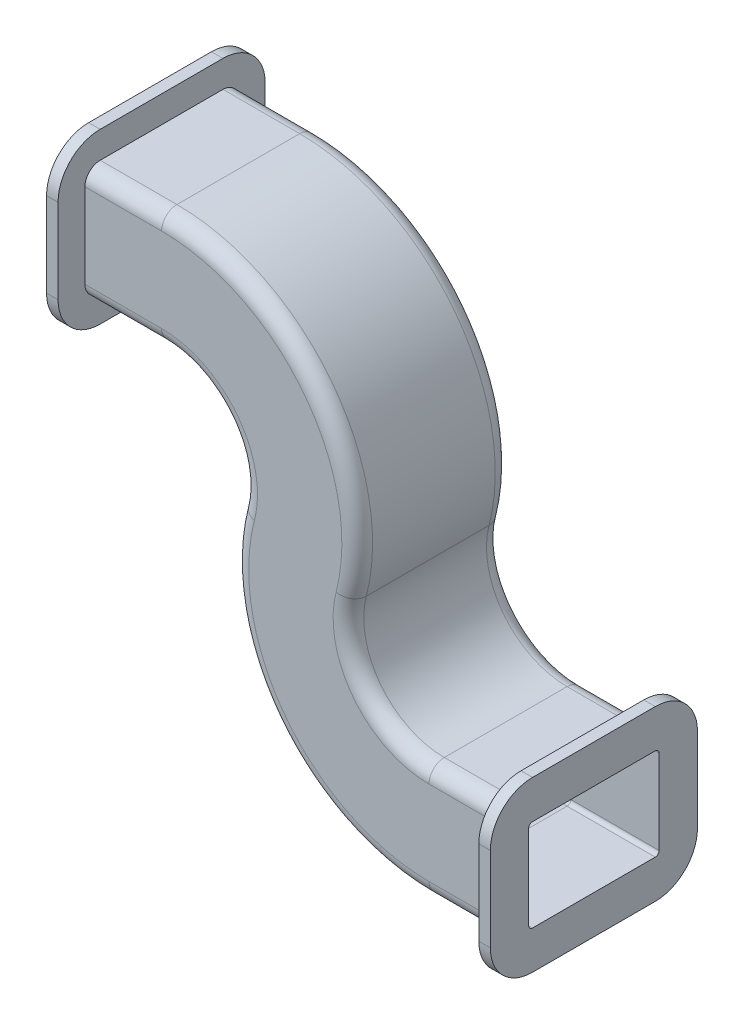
ISO-10303-21;
HEADER;
FILE_DESCRIPTION(('STEP AP214'),'2;1');
FILE_NAME('part.step','',(''),(''),'','','');
FILE_SCHEMA(('AUTOMOTIVE_DESIGN { 1 0 10303 214 1 1 1 1 }'));
ENDSEC;
DATA;
#1=APPLICATION_CONTEXT('core data for automotive mechanical design processes');
#2=APPLICATION_PROTOCOL_DEFINITION('international standard','automotive_design',2000,#1);
#3=PRODUCT_CONTEXT('',#1,'mechanical');
#4=PRODUCT('Part','Part','',(#3));
#5=PRODUCT_RELATED_PRODUCT_CATEGORY('part','',(#4));
#6=PRODUCT_DEFINITION_FORMATION('','',#4);
#7=PRODUCT_DEFINITION_CONTEXT('part definition',#1,'design');
#8=PRODUCT_DEFINITION('design','',#6,#7);
#9=PRODUCT_DEFINITION_SHAPE('','',#8);
#10=(LENGTH_UNIT() NAMED_UNIT(*) SI_UNIT(.MILLI.,.METRE.));
#11=(NAMED_UNIT(*) PLANE_ANGLE_UNIT() SI_UNIT($,.RADIAN.));
#12=(NAMED_UNIT(*) SI_UNIT($,.STERADIAN.) SOLID_ANGLE_UNIT());
#13=UNCERTAINTY_MEASURE_WITH_UNIT(LENGTH_MEASURE(1.E-05),#10,'distance_accuracy_value','');
#14=(GEOMETRIC_REPRESENTATION_CONTEXT(3) GLOBAL_UNCERTAINTY_ASSIGNED_CONTEXT((#13)) GLOBAL_UNIT_ASSIGNED_CONTEXT((#10,
#11,#12)) REPRESENTATION_CONTEXT('',''));
#15=CARTESIAN_POINT('',(0.,0.,0.));
#16=DIRECTION('',(0.,0.,1.));
#17=DIRECTION('',(1.,0.,0.));
#18=AXIS2_PLACEMENT_3D('',#15,#16,#17);
#19=CARTESIAN_POINT('',(0.,19.05,20.32));
#20=DIRECTION('',(0.,1.,0.));
#21=DIRECTION('',(0.,0.,1.));
#22=AXIS2_PLACEMENT_3D('',#19,#20,#21);
#23=PLANE('',#22);
#24=DIRECTION('',(1.,0.,0.));
#25=VECTOR('',#24,1.);
#26=CARTESIAN_POINT('',(0.,19.05,20.32));
#27=LINE('',#26,#25);
#28=CARTESIAN_POINT('',(0.,19.05,20.32));
#29=VERTEX_POINT('',#28);
#30=CARTESIAN_POINT('',(25.4,19.05,20.32));
#31=VERTEX_POINT('',#30);
#32=EDGE_CURVE('E714',#29,#31,#27,.T.);
#33=ORIENTED_EDGE('',*,*,#32,.T.);
#34=DIRECTION('',(0.,0.,1.));
#35=VECTOR('',#34,1.);
#36=CARTESIAN_POINT('',(25.4,19.05,20.32));
#37=LINE('',#36,#35);
#38=CARTESIAN_POINT('',(25.4,19.05,-20.32));
#39=VERTEX_POINT('',#38);
#40=EDGE_CURVE('E711',#39,#31,#37,.T.);
#41=ORIENTED_EDGE('',*,*,#40,.F.);
#42=DIRECTION('',(1.,0.,0.));
#43=VECTOR('',#42,1.);
#44=CARTESIAN_POINT('',(0.,19.05,-20.32));
#45=LINE('',#44,#43);
#46=CARTESIAN_POINT('',(0.,19.05,-20.32));
#47=VERTEX_POINT('',#46);
#48=EDGE_CURVE('E715',#47,#39,#45,.T.);
#49=ORIENTED_EDGE('',*,*,#48,.F.);
#50=DIRECTION('',(0.,0.,1.));
#51=VECTOR('',#50,1.);
#52=CARTESIAN_POINT('',(0.,19.05,20.32));
#53=LINE('',#52,#51);
#54=EDGE_CURVE('E707',#47,#29,#53,.T.);
#55=ORIENTED_EDGE('',*,*,#54,.T.);
#56=EDGE_LOOP('',(#33,#41,#49,#55));
#57=FACE_BOUND('',#56,.T.);
#58=ADVANCED_FACE('F34',(#57),#23,.T.);
#59=CARTESIAN_POINT('',(0.,13.97,20.32));
#60=DIRECTION('',(1.,0.,0.));
#61=DIRECTION('',(0.,0.,-1.));
#62=AXIS2_PLACEMENT_3D('',#59,#60,#61);
#63=CYLINDRICAL_SURFACE('',#62,5.08);
#64=DIRECTION('',(1.,0.,0.));
#65=VECTOR('',#64,1.);
#66=CARTESIAN_POINT('',(0.,13.97,25.4));
#67=LINE('',#66,#65);
#68=CARTESIAN_POINT('',(0.,13.97,25.4));
#69=VERTEX_POINT('',#68);
#70=CARTESIAN_POINT('',(25.4,13.97,25.4));
#71=VERTEX_POINT('',#70);
#72=EDGE_CURVE('E760',#69,#71,#67,.T.);
#73=ORIENTED_EDGE('',*,*,#72,.T.);
#74=CARTESIAN_POINT('',(25.4,13.97,20.32));
#75=DIRECTION('',(1.,0.,0.));
#76=DIRECTION('',(0.,0.,1.));
#77=AXIS2_PLACEMENT_3D('',#74,#75,#76);
#78=CIRCLE('',#77,5.08);
#79=EDGE_CURVE('E718',#31,#71,#78,.T.);
#80=ORIENTED_EDGE('',*,*,#79,.F.);
#81=ORIENTED_EDGE('',*,*,#32,.F.);
#82=CARTESIAN_POINT('',(0.,13.97,20.32));
#83=DIRECTION('',(1.,0.,0.));
#84=DIRECTION('',(0.,0.,1.));
#85=AXIS2_PLACEMENT_3D('',#82,#83,#84);
#86=CIRCLE('',#85,5.08);
#87=EDGE_CURVE('E710',#29,#69,#86,.T.);
#88=ORIENTED_EDGE('',*,*,#87,.T.);
#89=EDGE_LOOP('',(#73,#80,#81,#88));
#90=FACE_BOUND('',#89,.T.);
#91=ADVANCED_FACE('F1012',(#90),#63,.T.);
#92=CARTESIAN_POINT('',(0.,-13.97,25.4));
#93=DIRECTION('',(0.,0.,1.));
#94=DIRECTION('',(1.,0.,0.));
#95=AXIS2_PLACEMENT_3D('',#92,#93,#94);
#96=PLANE('',#95);
#97=DIRECTION('',(1.,0.,0.));
#98=VECTOR('',#97,1.);
#99=CARTESIAN_POINT('',(0.,-13.97,25.4));
#100=LINE('',#99,#98);
#101=CARTESIAN_POINT('',(0.,-13.97,25.4));
#102=VERTEX_POINT('',#101);
#103=CARTESIAN_POINT('',(25.4,-13.97,25.4));
#104=VERTEX_POINT('',#103);
#105=EDGE_CURVE('E763',#102,#104,#100,.T.);
#106=ORIENTED_EDGE('',*,*,#105,.T.);
#107=CARTESIAN_POINT('',(25.4,-45.72,25.4));
#108=DIRECTION('',(0.,0.,-1.));
#109=DIRECTION('',(0.,1.,0.));
#110=AXIS2_PLACEMENT_3D('',#107,#108,#109);
#111=CIRCLE('',#110,31.75);
#112=CARTESIAN_POINT('',(56.1418053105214,-53.6575,25.4));
#113=VERTEX_POINT('',#112);
#114=EDGE_CURVE('E769',#104,#113,#111,.T.);
#115=ORIENTED_EDGE('',*,*,#114,.T.);
#116=CARTESIAN_POINT('',(113.936399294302,-68.58,25.4));
#117=DIRECTION('',(0.,0.,1.));
#118=DIRECTION('',(-0.968245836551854,0.25,0.));
#119=AXIS2_PLACEMENT_3D('',#116,#117,#118);
#120=CIRCLE('',#119,59.69);
#121=CARTESIAN_POINT('',(113.936399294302,-128.27,25.4));
#122=VERTEX_POINT('',#121);
#123=EDGE_CURVE('E775',#113,#122,#120,.T.);
#124=ORIENTED_EDGE('',*,*,#123,.T.);
#125=DIRECTION('',(1.,0.,0.));
#126=VECTOR('',#125,1.);
#127=CARTESIAN_POINT('',(113.936399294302,-128.27,25.4));
#128=LINE('',#127,#126);
#129=CARTESIAN_POINT('',(139.336399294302,-128.27,25.4));
#130=VERTEX_POINT('',#129);
#131=EDGE_CURVE('E796',#122,#130,#128,.T.);
#132=ORIENTED_EDGE('',*,*,#131,.T.);
#133=DIRECTION('',(0.,-1.,0.));
#134=VECTOR('',#133,1.);
#135=CARTESIAN_POINT('',(139.336399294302,-128.27,25.4));
#136=LINE('',#135,#134);
#137=CARTESIAN_POINT('',(139.336399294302,-100.33,25.4));
#138=VERTEX_POINT('',#137);
#139=EDGE_CURVE('E781',#138,#130,#136,.T.);
#140=ORIENTED_EDGE('',*,*,#139,.F.);
#141=DIRECTION('',(1.,0.,0.));
#142=VECTOR('',#141,1.);
#143=CARTESIAN_POINT('',(113.936399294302,-100.33,25.4));
#144=LINE('',#143,#142);
#145=CARTESIAN_POINT('',(113.936399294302,-100.33,25.4));
#146=VERTEX_POINT('',#145);
#147=EDGE_CURVE('E778',#146,#138,#144,.T.);
#148=ORIENTED_EDGE('',*,*,#147,.F.);
#149=CARTESIAN_POINT('',(113.936399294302,-68.58,25.4));
#150=DIRECTION('',(0.,0.,1.));
#151=DIRECTION('',(-0.968245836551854,0.25,0.));
#152=AXIS2_PLACEMENT_3D('',#149,#150,#151);
#153=CIRCLE('',#152,31.75);
#154=CARTESIAN_POINT('',(83.1945939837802,-60.6425,25.4));
#155=VERTEX_POINT('',#154);
#156=EDGE_CURVE('E772',#155,#146,#153,.T.);
#157=ORIENTED_EDGE('',*,*,#156,.F.);
#158=CARTESIAN_POINT('',(25.4,-45.72,25.4));
#159=DIRECTION('',(0.,0.,-1.));
#160=DIRECTION('',(0.,1.,0.));
#161=AXIS2_PLACEMENT_3D('',#158,#159,#160);
#162=CIRCLE('',#161,59.69);
#163=EDGE_CURVE('E766',#71,#155,#162,.T.);
#164=ORIENTED_EDGE('',*,*,#163,.F.);
#165=ORIENTED_EDGE('',*,*,#72,.F.);
#166=DIRECTION('',(0.,-1.,0.));
#167=VECTOR('',#166,1.);
#168=CARTESIAN_POINT('',(0.,-13.97,25.4));
#169=LINE('',#168,#167);
#170=EDGE_CURVE('E757',#69,#102,#169,.T.);
#171=ORIENTED_EDGE('',*,*,#170,.T.);
#172=EDGE_LOOP('',(#106,#115,#124,#132,#140,#148,#157,#164,#165,#171));
#173=FACE_BOUND('',#172,.T.);
#174=ADVANCED_FACE('F936',(#173),#96,.T.);
#175=CARTESIAN_POINT('',(0.,-13.97,20.32));
#176=DIRECTION('',(1.,0.,0.));
#177=DIRECTION('',(0.,0.,-1.));
#178=AXIS2_PLACEMENT_3D('',#175,#176,#177);
#179=CYLINDRICAL_SURFACE('',#178,5.08);
#180=DIRECTION('',(1.,0.,0.));
#181=VECTOR('',#180,1.);
#182=CARTESIAN_POINT('',(0.,-19.05,20.32));
#183=LINE('',#182,#181);
#184=CARTESIAN_POINT('',(0.,-19.05,20.32));
#185=VERTEX_POINT('',#184);
#186=CARTESIAN_POINT('',(25.4,-19.05,20.32));
#187=VERTEX_POINT('',#186);
#188=EDGE_CURVE('E805',#185,#187,#183,.T.);
#189=ORIENTED_EDGE('',*,*,#188,.T.);
#190=CARTESIAN_POINT('',(25.4,-13.97,20.32));
#191=DIRECTION('',(1.,0.,0.));
#192=DIRECTION('',(0.,0.,1.));
#193=AXIS2_PLACEMENT_3D('',#190,#191,#192);
#194=CIRCLE('',#193,5.08);
#195=EDGE_CURVE('E787',#104,#187,#194,.T.);
#196=ORIENTED_EDGE('',*,*,#195,.F.);
#197=ORIENTED_EDGE('',*,*,#105,.F.);
#198=CARTESIAN_POINT('',(0.,-13.97,20.32));
#199=DIRECTION('',(1.,0.,0.));
#200=DIRECTION('',(0.,0.,1.));
#201=AXIS2_PLACEMENT_3D('',#198,#199,#200);
#202=CIRCLE('',#201,5.08);
#203=EDGE_CURVE('E784',#102,#185,#202,.T.);
#204=ORIENTED_EDGE('',*,*,#203,.T.);
#205=EDGE_LOOP('',(#189,#196,#197,#204));
#206=FACE_BOUND('',#205,.T.);
#207=ADVANCED_FACE('F998',(#206),#179,.T.);
#208=CARTESIAN_POINT('',(0.,-19.05,20.32));
#209=DIRECTION('',(0.,-1.,0.));
#210=DIRECTION('',(0.,0.,-1.));
#211=AXIS2_PLACEMENT_3D('',#208,#209,#210);
#212=PLANE('',#211);
#213=DIRECTION('',(1.,0.,0.));
#214=VECTOR('',#213,1.);
#215=CARTESIAN_POINT('',(0.,-19.05,-20.32));
#216=LINE('',#215,#214);
#217=CARTESIAN_POINT('',(0.,-19.05,-20.32));
#218=VERTEX_POINT('',#217);
#219=CARTESIAN_POINT('',(25.4,-19.05,-20.32));
#220=VERTEX_POINT('',#219);
#221=EDGE_CURVE('E832',#218,#220,#216,.T.);
#222=ORIENTED_EDGE('',*,*,#221,.T.);
#223=DIRECTION('',(0.,0.,-1.));
#224=VECTOR('',#223,1.);
#225=CARTESIAN_POINT('',(25.4,-19.05,20.32));
#226=LINE('',#225,#224);
#227=EDGE_CURVE('E808',#187,#220,#226,.T.);
#228=ORIENTED_EDGE('',*,*,#227,.F.);
#229=ORIENTED_EDGE('',*,*,#188,.F.);
#230=DIRECTION('',(0.,0.,-1.));
#231=VECTOR('',#230,1.);
#232=CARTESIAN_POINT('',(0.,-19.05,20.32));
#233=LINE('',#232,#231);
#234=EDGE_CURVE('E802',#185,#218,#233,.T.);
#235=ORIENTED_EDGE('',*,*,#234,.T.);
#236=EDGE_LOOP('',(#222,#228,#229,#235));
#237=FACE_BOUND('',#236,.T.);
#238=ADVANCED_FACE('F992',(#237),#212,.T.);
#239=CARTESIAN_POINT('',(0.,-13.97,-20.32));
#240=DIRECTION('',(1.,0.,0.));
#241=DIRECTION('',(0.,0.,-1.));
#242=AXIS2_PLACEMENT_3D('',#239,#240,#241);
#243=CYLINDRICAL_SURFACE('',#242,5.08);
#244=DIRECTION('',(1.,0.,0.));
#245=VECTOR('',#244,1.);
#246=CARTESIAN_POINT('',(0.,-13.97,-25.4));
#247=LINE('',#246,#245);
#248=CARTESIAN_POINT('',(0.,-13.97,-25.4));
#249=VERTEX_POINT('',#248);
#250=CARTESIAN_POINT('',(25.4,-13.97,-25.4));
#251=VERTEX_POINT('',#250);
#252=EDGE_CURVE('E859',#249,#251,#247,.T.);
#253=ORIENTED_EDGE('',*,*,#252,.T.);
#254=CARTESIAN_POINT('',(25.4,-13.97,-20.32));
#255=DIRECTION('',(1.,0.,0.));
#256=DIRECTION('',(0.,0.,-1.));
#257=AXIS2_PLACEMENT_3D('',#254,#255,#256);
#258=CIRCLE('',#257,5.08);
#259=EDGE_CURVE('E835',#220,#251,#258,.T.);
#260=ORIENTED_EDGE('',*,*,#259,.F.);
#261=ORIENTED_EDGE('',*,*,#221,.F.);
#262=CARTESIAN_POINT('',(0.,-13.97,-20.32));
#263=DIRECTION('',(1.,0.,0.));
#264=DIRECTION('',(0.,0.,-1.));
#265=AXIS2_PLACEMENT_3D('',#262,#263,#264);
#266=CIRCLE('',#265,5.08);
#267=EDGE_CURVE('E829',#218,#249,#266,.T.);
#268=ORIENTED_EDGE('',*,*,#267,.T.);
#269=EDGE_LOOP('',(#253,#260,#261,#268));
#270=FACE_BOUND('',#269,.T.);
#271=ADVANCED_FACE('F917',(#270),#243,.T.);
#272=CARTESIAN_POINT('',(0.,-13.97,-25.4));
#273=DIRECTION('',(0.,0.,-1.));
#274=DIRECTION('',(-1.,0.,0.));
#275=AXIS2_PLACEMENT_3D('',#272,#273,#274);
#276=PLANE('',#275);
#277=DIRECTION('',(1.,0.,0.));
#278=VECTOR('',#277,1.);
#279=CARTESIAN_POINT('',(0.,13.97,-25.4));
#280=LINE('',#279,#278);
#281=CARTESIAN_POINT('',(0.,13.97,-25.4));
#282=VERTEX_POINT('',#281);
#283=CARTESIAN_POINT('',(25.4,13.97,-25.4));
#284=VERTEX_POINT('',#283);
#285=EDGE_CURVE('E862',#282,#284,#280,.T.);
#286=ORIENTED_EDGE('',*,*,#285,.T.);
#287=CARTESIAN_POINT('',(25.4,-45.72,-25.4));
#288=DIRECTION('',(0.,0.,-1.));
#289=DIRECTION('',(0.,1.,0.));
#290=AXIS2_PLACEMENT_3D('',#287,#288,#289);
#291=CIRCLE('',#290,59.69);
#292=CARTESIAN_POINT('',(83.1945939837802,-60.6425,-25.4));
#293=VERTEX_POINT('',#292);
#294=EDGE_CURVE('E867',#284,#293,#291,.T.);
#295=ORIENTED_EDGE('',*,*,#294,.T.);
#296=CARTESIAN_POINT('',(113.936399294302,-68.58,-25.4));
#297=DIRECTION('',(0.,0.,1.));
#298=DIRECTION('',(-0.968245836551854,0.25,0.));
#299=AXIS2_PLACEMENT_3D('',#296,#297,#298);
#300=CIRCLE('',#299,31.75);
#301=CARTESIAN_POINT('',(113.936399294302,-100.33,-25.4));
#302=VERTEX_POINT('',#301);
#303=EDGE_CURVE('E72',#293,#302,#300,.T.);
#304=ORIENTED_EDGE('',*,*,#303,.T.);
#305=DIRECTION('',(1.,0.,0.));
#306=VECTOR('',#305,1.);
#307=CARTESIAN_POINT('',(113.936399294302,-100.33,-25.4));
#308=LINE('',#307,#306);
#309=CARTESIAN_POINT('',(139.336399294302,-100.33,-25.4));
#310=VERTEX_POINT('',#309);
#311=EDGE_CURVE('E43',#302,#310,#308,.T.);
#312=ORIENTED_EDGE('',*,*,#311,.T.);
#313=DIRECTION('',(0.,1.,0.));
#314=VECTOR('',#313,1.);
#315=CARTESIAN_POINT('',(139.336399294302,-128.27,-25.4));
#316=LINE('',#315,#314);
#317=CARTESIAN_POINT('',(139.336399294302,-128.27,-25.4));
#318=VERTEX_POINT('',#317);
#319=EDGE_CURVE('E51',#318,#310,#316,.T.);
#320=ORIENTED_EDGE('',*,*,#319,.F.);
#321=DIRECTION('',(1.,0.,0.));
#322=VECTOR('',#321,1.);
#323=CARTESIAN_POINT('',(113.936399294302,-128.27,-25.4));
#324=LINE('',#323,#322);
#325=CARTESIAN_POINT('',(113.936399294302,-128.27,-25.4));
#326=VERTEX_POINT('',#325);
#327=EDGE_CURVE('E873',#326,#318,#324,.T.);
#328=ORIENTED_EDGE('',*,*,#327,.F.);
#329=CARTESIAN_POINT('',(113.936399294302,-68.58,-25.4));
#330=DIRECTION('',(0.,0.,1.));
#331=DIRECTION('',(-0.968245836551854,0.25,0.));
#332=AXIS2_PLACEMENT_3D('',#329,#330,#331);
#333=CIRCLE('',#332,59.69);
#334=CARTESIAN_POINT('',(56.1418053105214,-53.6575,-25.4));
#335=VERTEX_POINT('',#334);
#336=EDGE_CURVE('E81',#335,#326,#333,.T.);
#337=ORIENTED_EDGE('',*,*,#336,.F.);
#338=CARTESIAN_POINT('',(25.4,-45.72,-25.4));
#339=DIRECTION('',(0.,0.,-1.));
#340=DIRECTION('',(0.,1.,0.));
#341=AXIS2_PLACEMENT_3D('',#338,#339,#340);
#342=CIRCLE('',#341,31.75);
#343=EDGE_CURVE('E865',#251,#335,#342,.T.);
#344=ORIENTED_EDGE('',*,*,#343,.F.);
#345=ORIENTED_EDGE('',*,*,#252,.F.);
#346=DIRECTION('',(0.,1.,0.));
#347=VECTOR('',#346,1.);
#348=CARTESIAN_POINT('',(0.,-13.97,-25.4));
#349=LINE('',#348,#347);
#350=EDGE_CURVE('E856',#249,#282,#349,.T.);
#351=ORIENTED_EDGE('',*,*,#350,.T.);
#352=EDGE_LOOP('',(#286,#295,#304,#312,#320,#328,#337,#344,#345,#351));
#353=FACE_BOUND('',#352,.T.);
#354=ADVANCED_FACE('F914',(#353),#276,.T.);
#355=CARTESIAN_POINT('',(0.,13.97,-20.32));
#356=DIRECTION('',(1.,0.,0.));
#357=DIRECTION('',(0.,0.,-1.));
#358=AXIS2_PLACEMENT_3D('',#355,#356,#357);
#359=CYLINDRICAL_SURFACE('',#358,5.08);
#360=CARTESIAN_POINT('',(25.4,13.97,-20.32));
#361=DIRECTION('',(1.,0.,0.));
#362=DIRECTION('',(0.,0.,1.));
#363=AXIS2_PLACEMENT_3D('',#360,#361,#362);
#364=CIRCLE('',#363,5.08);
#365=EDGE_CURVE('E732',#284,#39,#364,.T.);
#366=ORIENTED_EDGE('',*,*,#365,.F.);
#367=ORIENTED_EDGE('',*,*,#285,.F.);
#368=CARTESIAN_POINT('',(0.,13.97,-20.32));
#369=DIRECTION('',(1.,0.,0.));
#370=DIRECTION('',(0.,0.,1.));
#371=AXIS2_PLACEMENT_3D('',#368,#369,#370);
#372=CIRCLE('',#371,5.08);
#373=EDGE_CURVE('E721',#282,#47,#372,.T.);
#374=ORIENTED_EDGE('',*,*,#373,.T.);
#375=ORIENTED_EDGE('',*,*,#48,.T.);
#376=EDGE_LOOP('',(#366,#367,#374,#375));
#377=FACE_BOUND('',#376,.T.);
#378=ADVANCED_FACE('F909',(#377),#359,.T.);
#379=CARTESIAN_POINT('',(25.4,-45.72,0.));
#380=DIRECTION('',(0.,0.,-1.));
#381=DIRECTION('',(-1.,0.,0.));
#382=AXIS2_PLACEMENT_3D('',#379,#380,#381);
#383=CYLINDRICAL_SURFACE('',#382,64.77);
#384=CARTESIAN_POINT('',(25.4,-45.72,20.32));
#385=DIRECTION('',(0.,0.,-1.));
#386=DIRECTION('',(0.,1.,0.));
#387=AXIS2_PLACEMENT_3D('',#384,#385,#386);
#388=CIRCLE('',#387,64.77);
#389=CARTESIAN_POINT('',(88.1132828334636,-61.9125,20.32));
#390=VERTEX_POINT('',#389);
#391=EDGE_CURVE('E725',#31,#390,#388,.T.);
#392=ORIENTED_EDGE('',*,*,#391,.T.);
#393=DIRECTION('',(0.,0.,1.));
#394=VECTOR('',#393,1.);
#395=CARTESIAN_POINT('',(88.1132828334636,-61.9125,20.32));
#396=LINE('',#395,#394);
#397=CARTESIAN_POINT('',(88.1132828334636,-61.9125,-20.32));
#398=VERTEX_POINT('',#397);
#399=EDGE_CURVE('E722',#398,#390,#396,.T.);
#400=ORIENTED_EDGE('',*,*,#399,.F.);
#401=CARTESIAN_POINT('',(25.4,-45.72,-20.32));
#402=DIRECTION('',(0.,0.,-1.));
#403=DIRECTION('',(0.,1.,0.));
#404=AXIS2_PLACEMENT_3D('',#401,#402,#403);
#405=CIRCLE('',#404,64.77);
#406=EDGE_CURVE('E726',#39,#398,#405,.T.);
#407=ORIENTED_EDGE('',*,*,#406,.F.);
#408=ORIENTED_EDGE('',*,*,#40,.T.);
#409=EDGE_LOOP('',(#392,#400,#407,#408));
#410=FACE_BOUND('',#409,.T.);
#411=ADVANCED_FACE('F900',(#410),#383,.T.);
#412=CARTESIAN_POINT('',(25.4,-45.72,20.32));
#413=DIRECTION('',(0.,0.,-1.));
#414=DIRECTION('',(-1.,0.,0.));
#415=AXIS2_PLACEMENT_3D('',#412,#413,#414);
#416=TOROIDAL_SURFACE('',#415,59.69,5.08);
#417=ORIENTED_EDGE('',*,*,#163,.T.);
#418=CARTESIAN_POINT('',(83.1945939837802,-60.6425,20.32));
#419=DIRECTION('',(-0.25,-0.968245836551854,0.));
#420=DIRECTION('',(0.,0.,1.));
#421=AXIS2_PLACEMENT_3D('',#418,#419,#420);
#422=CIRCLE('',#421,5.08);
#423=EDGE_CURVE('E729',#390,#155,#422,.T.);
#424=ORIENTED_EDGE('',*,*,#423,.F.);
#425=ORIENTED_EDGE('',*,*,#391,.F.);
#426=ORIENTED_EDGE('',*,*,#79,.T.);
#427=EDGE_LOOP('',(#417,#424,#425,#426));
#428=FACE_BOUND('',#427,.T.);
#429=ADVANCED_FACE('F1006',(#428),#416,.T.);
#430=CARTESIAN_POINT('',(25.4,-45.72,20.32));
#431=DIRECTION('',(0.,0.,-1.));
#432=DIRECTION('',(-1.,0.,0.));
#433=AXIS2_PLACEMENT_3D('',#430,#431,#432);
#434=TOROIDAL_SURFACE('',#433,31.75,5.08);
#435=CARTESIAN_POINT('',(25.4,-45.72,20.32));
#436=DIRECTION('',(0.,0.,-1.));
#437=DIRECTION('',(0.,1.,0.));
#438=AXIS2_PLACEMENT_3D('',#435,#436,#437);
#439=CIRCLE('',#438,26.67);
#440=CARTESIAN_POINT('',(51.223116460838,-52.3875,20.32));
#441=VERTEX_POINT('',#440);
#442=EDGE_CURVE('E811',#187,#441,#439,.T.);
#443=ORIENTED_EDGE('',*,*,#442,.T.);
#444=CARTESIAN_POINT('',(56.1418053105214,-53.6575,20.32));
#445=DIRECTION('',(-0.25,-0.968245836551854,0.));
#446=DIRECTION('',(0.,0.,1.));
#447=AXIS2_PLACEMENT_3D('',#444,#445,#446);
#448=CIRCLE('',#447,5.08);
#449=EDGE_CURVE('E790',#113,#441,#448,.T.);
#450=ORIENTED_EDGE('',*,*,#449,.F.);
#451=ORIENTED_EDGE('',*,*,#114,.F.);
#452=ORIENTED_EDGE('',*,*,#195,.T.);
#453=EDGE_LOOP('',(#443,#450,#451,#452));
#454=FACE_BOUND('',#453,.T.);
#455=ADVANCED_FACE('F988',(#454),#434,.T.);
#456=CARTESIAN_POINT('',(25.4,-45.72,0.));
#457=DIRECTION('',(0.,0.,-1.));
#458=DIRECTION('',(-1.,0.,0.));
#459=AXIS2_PLACEMENT_3D('',#456,#457,#458);
#460=CYLINDRICAL_SURFACE('',#459,26.67);
#461=CARTESIAN_POINT('',(25.4,-45.72,-20.32));
#462=DIRECTION('',(0.,0.,-1.));
#463=DIRECTION('',(0.,1.,0.));
#464=AXIS2_PLACEMENT_3D('',#461,#462,#463);
#465=CIRCLE('',#464,26.67);
#466=CARTESIAN_POINT('',(51.223116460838,-52.3875,-20.32));
#467=VERTEX_POINT('',#466);
#468=EDGE_CURVE('E838',#220,#467,#465,.T.);
#469=ORIENTED_EDGE('',*,*,#468,.T.);
#470=DIRECTION('',(0.,0.,-1.));
#471=VECTOR('',#470,1.);
#472=CARTESIAN_POINT('',(51.223116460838,-52.3875,20.32));
#473=LINE('',#472,#471);
#474=EDGE_CURVE('E814',#441,#467,#473,.T.);
#475=ORIENTED_EDGE('',*,*,#474,.F.);
#476=ORIENTED_EDGE('',*,*,#442,.F.);
#477=ORIENTED_EDGE('',*,*,#227,.T.);
#478=EDGE_LOOP('',(#469,#475,#476,#477));
#479=FACE_BOUND('',#478,.T.);
#480=ADVANCED_FACE('F924',(#479),#460,.F.);
#481=CARTESIAN_POINT('',(25.4,-45.72,-20.32));
#482=DIRECTION('',(0.,0.,-1.));
#483=DIRECTION('',(-1.,0.,0.));
#484=AXIS2_PLACEMENT_3D('',#481,#482,#483);
#485=TOROIDAL_SURFACE('',#484,31.75,5.08);
#486=ORIENTED_EDGE('',*,*,#343,.T.);
#487=CARTESIAN_POINT('',(56.1418053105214,-53.6575,-20.32));
#488=DIRECTION('',(-0.25,-0.968245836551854,0.));
#489=DIRECTION('',(0.,0.,-1.));
#490=AXIS2_PLACEMENT_3D('',#487,#488,#489);
#491=CIRCLE('',#490,5.08);
#492=EDGE_CURVE('E841',#467,#335,#491,.T.);
#493=ORIENTED_EDGE('',*,*,#492,.F.);
#494=ORIENTED_EDGE('',*,*,#468,.F.);
#495=ORIENTED_EDGE('',*,*,#259,.T.);
#496=EDGE_LOOP('',(#486,#493,#494,#495));
#497=FACE_BOUND('',#496,.T.);
#498=ADVANCED_FACE('F920',(#497),#485,.T.);
#499=CARTESIAN_POINT('',(25.4,-45.72,-20.32));
#500=DIRECTION('',(0.,0.,-1.));
#501=DIRECTION('',(-1.,0.,0.));
#502=AXIS2_PLACEMENT_3D('',#499,#500,#501);
#503=TOROIDAL_SURFACE('',#502,59.69,5.08);
#504=CARTESIAN_POINT('',(83.1945939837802,-60.6425,-20.32));
#505=DIRECTION('',(-0.25,-0.968245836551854,0.));
#506=DIRECTION('',(0.,0.,1.));
#507=AXIS2_PLACEMENT_3D('',#504,#505,#506);
#508=CIRCLE('',#507,5.08);
#509=EDGE_CURVE('E743',#293,#398,#508,.T.);
#510=ORIENTED_EDGE('',*,*,#509,.F.);
#511=ORIENTED_EDGE('',*,*,#294,.F.);
#512=ORIENTED_EDGE('',*,*,#365,.T.);
#513=ORIENTED_EDGE('',*,*,#406,.T.);
#514=EDGE_LOOP('',(#510,#511,#512,#513));
#515=FACE_BOUND('',#514,.T.);
#516=ADVANCED_FACE('F901',(#515),#503,.T.);
#517=CARTESIAN_POINT('',(113.936399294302,-68.58,0.));
#518=DIRECTION('',(0.,0.,1.));
#519=DIRECTION('',(1.,0.,0.));
#520=AXIS2_PLACEMENT_3D('',#517,#518,#519);
#521=CYLINDRICAL_SURFACE('',#520,26.67);
#522=CARTESIAN_POINT('',(113.936399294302,-68.58,20.32));
#523=DIRECTION('',(0.,0.,1.));
#524=DIRECTION('',(-0.968245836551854,0.25,0.));
#525=AXIS2_PLACEMENT_3D('',#522,#523,#524);
#526=CIRCLE('',#525,26.67);
#527=CARTESIAN_POINT('',(113.936399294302,-95.25,20.32));
#528=VERTEX_POINT('',#527);
#529=EDGE_CURVE('E736',#390,#528,#526,.T.);
#530=ORIENTED_EDGE('',*,*,#529,.T.);
#531=DIRECTION('',(0.,0.,1.));
#532=VECTOR('',#531,1.);
#533=CARTESIAN_POINT('',(113.936399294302,-95.25,20.32));
#534=LINE('',#533,#532);
#535=CARTESIAN_POINT('',(113.936399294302,-95.25,-20.32));
#536=VERTEX_POINT('',#535);
#537=EDGE_CURVE('E733',#536,#528,#534,.T.);
#538=ORIENTED_EDGE('',*,*,#537,.F.);
#539=CARTESIAN_POINT('',(113.936399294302,-68.58,-20.32));
#540=DIRECTION('',(0.,0.,1.));
#541=DIRECTION('',(-0.968245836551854,0.25,0.));
#542=AXIS2_PLACEMENT_3D('',#539,#540,#541);
#543=CIRCLE('',#542,26.67);
#544=EDGE_CURVE('E737',#398,#536,#543,.T.);
#545=ORIENTED_EDGE('',*,*,#544,.F.);
#546=ORIENTED_EDGE('',*,*,#399,.T.);
#547=EDGE_LOOP('',(#530,#538,#545,#546));
#548=FACE_BOUND('',#547,.T.);
#549=ADVANCED_FACE('F894',(#548),#521,.F.);
#550=CARTESIAN_POINT('',(113.936399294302,-68.58,20.32));
#551=DIRECTION('',(0.,0.,1.));
#552=DIRECTION('',(1.,0.,0.));
#553=AXIS2_PLACEMENT_3D('',#550,#551,#552);
#554=TOROIDAL_SURFACE('',#553,31.75,5.08);
#555=ORIENTED_EDGE('',*,*,#156,.T.);
#556=CARTESIAN_POINT('',(113.936399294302,-100.33,20.32));
#557=DIRECTION('',(1.,0.,0.));
#558=DIRECTION('',(0.,0.,1.));
#559=AXIS2_PLACEMENT_3D('',#556,#557,#558);
#560=CIRCLE('',#559,5.08);
#561=EDGE_CURVE('E740',#528,#146,#560,.T.);
#562=ORIENTED_EDGE('',*,*,#561,.F.);
#563=ORIENTED_EDGE('',*,*,#529,.F.);
#564=ORIENTED_EDGE('',*,*,#423,.T.);
#565=EDGE_LOOP('',(#555,#562,#563,#564));
#566=FACE_BOUND('',#565,.T.);
#567=ADVANCED_FACE('F984',(#566),#554,.T.);
#568=CARTESIAN_POINT('',(113.936399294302,-68.58,20.32));
#569=DIRECTION('',(0.,0.,1.));
#570=DIRECTION('',(1.,0.,0.));
#571=AXIS2_PLACEMENT_3D('',#568,#569,#570);
#572=TOROIDAL_SURFACE('',#571,59.69,5.08);
#573=CARTESIAN_POINT('',(113.936399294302,-68.58,20.32));
#574=DIRECTION('',(0.,0.,1.));
#575=DIRECTION('',(-0.968245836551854,0.25,0.));
#576=AXIS2_PLACEMENT_3D('',#573,#574,#575);
#577=CIRCLE('',#576,64.77);
#578=CARTESIAN_POINT('',(113.936399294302,-133.35,20.32));
#579=VERTEX_POINT('',#578);
#580=EDGE_CURVE('E817',#441,#579,#577,.T.);
#581=ORIENTED_EDGE('',*,*,#580,.T.);
#582=CARTESIAN_POINT('',(113.936399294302,-128.27,20.32));
#583=DIRECTION('',(1.,0.,0.));
#584=DIRECTION('',(0.,0.,1.));
#585=AXIS2_PLACEMENT_3D('',#582,#583,#584);
#586=CIRCLE('',#585,5.08);
#587=EDGE_CURVE('E793',#122,#579,#586,.T.);
#588=ORIENTED_EDGE('',*,*,#587,.F.);
#589=ORIENTED_EDGE('',*,*,#123,.F.);
#590=ORIENTED_EDGE('',*,*,#449,.T.);
#591=EDGE_LOOP('',(#581,#588,#589,#590));
#592=FACE_BOUND('',#591,.T.);
#593=ADVANCED_FACE('F931',(#592),#572,.T.);
#594=CARTESIAN_POINT('',(113.936399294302,-68.58,0.));
#595=DIRECTION('',(0.,0.,1.));
#596=DIRECTION('',(1.,0.,0.));
#597=AXIS2_PLACEMENT_3D('',#594,#595,#596);
#598=CYLINDRICAL_SURFACE('',#597,64.77);
#599=CARTESIAN_POINT('',(113.936399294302,-68.58,-20.32));
#600=DIRECTION('',(0.,0.,1.));
#601=DIRECTION('',(-0.968245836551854,0.25,0.));
#602=AXIS2_PLACEMENT_3D('',#599,#600,#601);
#603=CIRCLE('',#602,64.77);
#604=CARTESIAN_POINT('',(113.936399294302,-133.35,-20.32));
#605=VERTEX_POINT('',#604);
#606=EDGE_CURVE('E844',#467,#605,#603,.T.);
#607=ORIENTED_EDGE('',*,*,#606,.T.);
#608=DIRECTION('',(0.,0.,-1.));
#609=VECTOR('',#608,1.);
#610=CARTESIAN_POINT('',(113.936399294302,-133.35,20.32));
#611=LINE('',#610,#609);
#612=EDGE_CURVE('E820',#579,#605,#611,.T.);
#613=ORIENTED_EDGE('',*,*,#612,.F.);
#614=ORIENTED_EDGE('',*,*,#580,.F.);
#615=ORIENTED_EDGE('',*,*,#474,.T.);
#616=EDGE_LOOP('',(#607,#613,#614,#615));
#617=FACE_BOUND('',#616,.T.);
#618=ADVANCED_FACE('F927',(#617),#598,.T.);
#619=CARTESIAN_POINT('',(113.936399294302,-68.58,-20.32));
#620=DIRECTION('',(0.,0.,1.));
#621=DIRECTION('',(1.,0.,0.));
#622=AXIS2_PLACEMENT_3D('',#619,#620,#621);
#623=TOROIDAL_SURFACE('',#622,59.69,5.08);
#624=ORIENTED_EDGE('',*,*,#336,.T.);
#625=CARTESIAN_POINT('',(113.936399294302,-128.27,-20.32));
#626=DIRECTION('',(1.,0.,0.));
#627=DIRECTION('',(0.,0.,-1.));
#628=AXIS2_PLACEMENT_3D('',#625,#626,#627);
#629=CIRCLE('',#628,5.08);
#630=EDGE_CURVE('E847',#605,#326,#629,.T.);
#631=ORIENTED_EDGE('',*,*,#630,.F.);
#632=ORIENTED_EDGE('',*,*,#606,.F.);
#633=ORIENTED_EDGE('',*,*,#492,.T.);
#634=EDGE_LOOP('',(#624,#631,#632,#633));
#635=FACE_BOUND('',#634,.T.);
#636=ADVANCED_FACE('F950',(#635),#623,.T.);
#637=CARTESIAN_POINT('',(113.936399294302,-68.58,-20.32));
#638=DIRECTION('',(0.,0.,1.));
#639=DIRECTION('',(1.,0.,0.));
#640=AXIS2_PLACEMENT_3D('',#637,#638,#639);
#641=TOROIDAL_SURFACE('',#640,31.75,5.08);
#642=CARTESIAN_POINT('',(113.936399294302,-100.33,-20.32));
#643=DIRECTION('',(1.,0.,0.));
#644=DIRECTION('',(0.,0.,1.));
#645=AXIS2_PLACEMENT_3D('',#642,#643,#644);
#646=CIRCLE('',#645,5.08);
#647=EDGE_CURVE('E754',#302,#536,#646,.T.);
#648=ORIENTED_EDGE('',*,*,#647,.F.);
#649=ORIENTED_EDGE('',*,*,#303,.F.);
#650=ORIENTED_EDGE('',*,*,#509,.T.);
#651=ORIENTED_EDGE('',*,*,#544,.T.);
#652=EDGE_LOOP('',(#648,#649,#650,#651));
#653=FACE_BOUND('',#652,.T.);
#654=ADVANCED_FACE('F896',(#653),#641,.T.);
#655=CARTESIAN_POINT('',(113.936399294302,-95.25,20.32));
#656=DIRECTION('',(0.,1.,0.));
#657=DIRECTION('',(0.,0.,1.));
#658=AXIS2_PLACEMENT_3D('',#655,#656,#657);
#659=PLANE('',#658);
#660=DIRECTION('',(1.,0.,0.));
#661=VECTOR('',#660,1.);
#662=CARTESIAN_POINT('',(113.936399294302,-95.25,20.32));
#663=LINE('',#662,#661);
#664=CARTESIAN_POINT('',(139.336399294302,-95.25,20.32));
#665=VERTEX_POINT('',#664);
#666=EDGE_CURVE('E747',#528,#665,#663,.T.);
#667=ORIENTED_EDGE('',*,*,#666,.T.);
#668=DIRECTION('',(0.,0.,1.));
#669=VECTOR('',#668,1.);
#670=CARTESIAN_POINT('',(139.336399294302,-95.25,20.32));
#671=LINE('',#670,#669);
#672=CARTESIAN_POINT('',(139.336399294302,-95.25,-20.32));
#673=VERTEX_POINT('',#672);
#674=EDGE_CURVE('E744',#673,#665,#671,.T.);
#675=ORIENTED_EDGE('',*,*,#674,.F.);
#676=DIRECTION('',(1.,0.,0.));
#677=VECTOR('',#676,1.);
#678=CARTESIAN_POINT('',(113.936399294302,-95.25,-20.32));
#679=LINE('',#678,#677);
#680=EDGE_CURVE('E748',#536,#673,#679,.T.);
#681=ORIENTED_EDGE('',*,*,#680,.F.);
#682=ORIENTED_EDGE('',*,*,#537,.T.);
#683=EDGE_LOOP('',(#667,#675,#681,#682));
#684=FACE_BOUND('',#683,.T.);
#685=ADVANCED_FACE('F942',(#684),#659,.T.);
#686=CARTESIAN_POINT('',(113.936399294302,-100.33,20.32));
#687=DIRECTION('',(1.,0.,0.));
#688=DIRECTION('',(0.,0.,-1.));
#689=AXIS2_PLACEMENT_3D('',#686,#687,#688);
#690=CYLINDRICAL_SURFACE('',#689,5.08);
#691=ORIENTED_EDGE('',*,*,#147,.T.);
#692=CARTESIAN_POINT('',(139.336399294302,-100.33,20.32));
#693=DIRECTION('',(1.,0.,0.));
#694=DIRECTION('',(0.,0.,1.));
#695=AXIS2_PLACEMENT_3D('',#692,#693,#694);
#696=CIRCLE('',#695,5.08);
#697=EDGE_CURVE('E751',#665,#138,#696,.T.);
#698=ORIENTED_EDGE('',*,*,#697,.F.);
#699=ORIENTED_EDGE('',*,*,#666,.F.);
#700=ORIENTED_EDGE('',*,*,#561,.T.);
#701=EDGE_LOOP('',(#691,#698,#699,#700));
#702=FACE_BOUND('',#701,.T.);
#703=ADVANCED_FACE('F940',(#702),#690,.T.);
#704=CARTESIAN_POINT('',(113.936399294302,-128.27,20.32));
#705=DIRECTION('',(1.,0.,0.));
#706=DIRECTION('',(0.,0.,-1.));
#707=AXIS2_PLACEMENT_3D('',#704,#705,#706);
#708=CYLINDRICAL_SURFACE('',#707,5.08);
#709=DIRECTION('',(1.,0.,0.));
#710=VECTOR('',#709,1.);
#711=CARTESIAN_POINT('',(113.936399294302,-133.35,20.32));
#712=LINE('',#711,#710);
#713=CARTESIAN_POINT('',(139.336399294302,-133.35,20.32));
#714=VERTEX_POINT('',#713);
#715=EDGE_CURVE('E823',#579,#714,#712,.T.);
#716=ORIENTED_EDGE('',*,*,#715,.T.);
#717=CARTESIAN_POINT('',(139.336399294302,-128.27,20.32));
#718=DIRECTION('',(1.,0.,0.));
#719=DIRECTION('',(0.,0.,1.));
#720=AXIS2_PLACEMENT_3D('',#717,#718,#719);
#721=CIRCLE('',#720,5.08);
#722=EDGE_CURVE('E799',#130,#714,#721,.T.);
#723=ORIENTED_EDGE('',*,*,#722,.F.);
#724=ORIENTED_EDGE('',*,*,#131,.F.);
#725=ORIENTED_EDGE('',*,*,#587,.T.);
#726=EDGE_LOOP('',(#716,#723,#724,#725));
#727=FACE_BOUND('',#726,.T.);
#728=ADVANCED_FACE('F934',(#727),#708,.T.);
#729=CARTESIAN_POINT('',(113.936399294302,-133.35,20.32));
#730=DIRECTION('',(0.,-1.,0.));
#731=DIRECTION('',(0.,0.,-1.));
#732=AXIS2_PLACEMENT_3D('',#729,#730,#731);
#733=PLANE('',#732);
#734=DIRECTION('',(1.,0.,0.));
#735=VECTOR('',#734,1.);
#736=CARTESIAN_POINT('',(113.936399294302,-133.35,-20.32));
#737=LINE('',#736,#735);
#738=CARTESIAN_POINT('',(139.336399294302,-133.35,-20.32));
#739=VERTEX_POINT('',#738);
#740=EDGE_CURVE('E850',#605,#739,#737,.T.);
#741=ORIENTED_EDGE('',*,*,#740,.T.);
#742=DIRECTION('',(0.,0.,-1.));
#743=VECTOR('',#742,1.);
#744=CARTESIAN_POINT('',(139.336399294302,-133.35,20.32));
#745=LINE('',#744,#743);
#746=EDGE_CURVE('E826',#714,#739,#745,.T.);
#747=ORIENTED_EDGE('',*,*,#746,.F.);
#748=ORIENTED_EDGE('',*,*,#715,.F.);
#749=ORIENTED_EDGE('',*,*,#612,.T.);
#750=EDGE_LOOP('',(#741,#747,#748,#749));
#751=FACE_BOUND('',#750,.T.);
#752=ADVANCED_FACE('F964',(#751),#733,.T.);
#753=CARTESIAN_POINT('',(113.936399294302,-128.27,-20.32));
#754=DIRECTION('',(1.,0.,0.));
#755=DIRECTION('',(0.,0.,-1.));
#756=AXIS2_PLACEMENT_3D('',#753,#754,#755);
#757=CYLINDRICAL_SURFACE('',#756,5.08);
#758=ORIENTED_EDGE('',*,*,#327,.T.);
#759=CARTESIAN_POINT('',(139.336399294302,-128.27,-20.32));
#760=DIRECTION('',(1.,0.,0.));
#761=DIRECTION('',(0.,0.,-1.));
#762=AXIS2_PLACEMENT_3D('',#759,#760,#761);
#763=CIRCLE('',#762,5.08);
#764=EDGE_CURVE('E853',#739,#318,#763,.T.);
#765=ORIENTED_EDGE('',*,*,#764,.F.);
#766=ORIENTED_EDGE('',*,*,#740,.F.);
#767=ORIENTED_EDGE('',*,*,#630,.T.);
#768=EDGE_LOOP('',(#758,#765,#766,#767));
#769=FACE_BOUND('',#768,.T.);
#770=ADVANCED_FACE('F955',(#769),#757,.T.);
#771=CARTESIAN_POINT('',(113.936399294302,-100.33,-20.32));
#772=DIRECTION('',(1.,0.,0.));
#773=DIRECTION('',(0.,0.,-1.));
#774=AXIS2_PLACEMENT_3D('',#771,#772,#773);
#775=CYLINDRICAL_SURFACE('',#774,5.08);
#776=CARTESIAN_POINT('',(139.336399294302,-100.33,-20.32));
#777=DIRECTION('',(1.,0.,0.));
#778=DIRECTION('',(0.,0.,1.));
#779=AXIS2_PLACEMENT_3D('',#776,#777,#778);
#780=CIRCLE('',#779,5.08);
#781=EDGE_CURVE('E11',#310,#673,#780,.T.);
#782=ORIENTED_EDGE('',*,*,#781,.F.);
#783=ORIENTED_EDGE('',*,*,#311,.F.);
#784=ORIENTED_EDGE('',*,*,#647,.T.);
#785=ORIENTED_EDGE('',*,*,#680,.T.);
#786=EDGE_LOOP('',(#782,#783,#784,#785));
#787=FACE_BOUND('',#786,.T.);
#788=ADVANCED_FACE('F36',(#787),#775,.T.);
#789=CARTESIAN_POINT('',(0.,15.24,20.32));
#790=DIRECTION('',(0.,1.,0.));
#791=DIRECTION('',(0.,0.,1.));
#792=AXIS2_PLACEMENT_3D('',#789,#790,#791);
#793=PLANE('',#792);
#794=DIRECTION('',(1.,0.,0.));
#795=VECTOR('',#794,1.);
#796=CARTESIAN_POINT('',(0.,15.24,20.32));
#797=LINE('',#796,#795);
#798=CARTESIAN_POINT('',(-3.81,15.24,20.32));
#799=VERTEX_POINT('',#798);
#800=CARTESIAN_POINT('',(25.4,15.24,20.32));
#801=VERTEX_POINT('',#800);
#802=EDGE_CURVE('E574',#799,#801,#797,.T.);
#803=ORIENTED_EDGE('',*,*,#802,.F.);
#804=DIRECTION('',(0.,0.,-1.));
#805=VECTOR('',#804,1.);
#806=CARTESIAN_POINT('',(-3.81,15.24,-20.32));
#807=LINE('',#806,#805);
#808=CARTESIAN_POINT('',(-3.81,15.24,-20.32));
#809=VERTEX_POINT('',#808);
#810=EDGE_CURVE('E506',#799,#809,#807,.T.);
#811=ORIENTED_EDGE('',*,*,#810,.T.);
#812=DIRECTION('',(1.,0.,0.));
#813=VECTOR('',#812,1.);
#814=CARTESIAN_POINT('',(0.,15.24,-20.32));
#815=LINE('',#814,#813);
#816=CARTESIAN_POINT('',(25.4,15.24,-20.32));
#817=VERTEX_POINT('',#816);
#818=EDGE_CURVE('E573',#809,#817,#815,.T.);
#819=ORIENTED_EDGE('',*,*,#818,.T.);
#820=DIRECTION('',(0.,0.,-1.));
#821=VECTOR('',#820,1.);
#822=CARTESIAN_POINT('',(25.4,15.24,0.));
#823=LINE('',#822,#821);
#824=EDGE_CURVE('E578',#817,#801,#823,.F.);
#825=ORIENTED_EDGE('',*,*,#824,.T.);
#826=EDGE_LOOP('',(#803,#811,#819,#825));
#827=FACE_BOUND('',#826,.T.);
#828=ADVANCED_FACE('F954',(#827),#793,.F.);
#829=CARTESIAN_POINT('',(0.,13.97,20.32));
#830=DIRECTION('',(1.,0.,0.));
#831=DIRECTION('',(0.,0.,-1.));
#832=AXIS2_PLACEMENT_3D('',#829,#830,#831);
#833=CYLINDRICAL_SURFACE('',#832,1.27);
#834=DIRECTION('',(1.,0.,0.));
#835=VECTOR('',#834,1.);
#836=CARTESIAN_POINT('',(0.,13.97,21.59));
#837=LINE('',#836,#835);
#838=CARTESIAN_POINT('',(-3.81,13.97,21.59));
#839=VERTEX_POINT('',#838);
#840=CARTESIAN_POINT('',(25.4,13.97,21.59));
#841=VERTEX_POINT('',#840);
#842=EDGE_CURVE('E583',#839,#841,#837,.T.);
#843=ORIENTED_EDGE('',*,*,#842,.F.);
#844=CARTESIAN_POINT('',(-3.81,13.97,20.32));
#845=DIRECTION('',(-1.,0.,0.));
#846=DIRECTION('',(0.,0.,1.));
#847=AXIS2_PLACEMENT_3D('',#844,#845,#846);
#848=CIRCLE('',#847,1.27);
#849=EDGE_CURVE('E503',#839,#799,#848,.T.);
#850=ORIENTED_EDGE('',*,*,#849,.T.);
#851=ORIENTED_EDGE('',*,*,#802,.T.);
#852=CARTESIAN_POINT('',(25.4,13.97,20.32));
#853=DIRECTION('',(-1.,0.,0.));
#854=DIRECTION('',(0.,-1.,0.));
#855=AXIS2_PLACEMENT_3D('',#852,#853,#854);
#856=CIRCLE('',#855,1.27);
#857=EDGE_CURVE('E577',#801,#841,#856,.F.);
#858=ORIENTED_EDGE('',*,*,#857,.T.);
#859=EDGE_LOOP('',(#843,#850,#851,#858));
#860=FACE_BOUND('',#859,.T.);
#861=ADVANCED_FACE('F960',(#860),#833,.F.);
#862=CARTESIAN_POINT('',(0.,-13.97,21.59));
#863=DIRECTION('',(0.,0.,1.));
#864=DIRECTION('',(1.,0.,0.));
#865=AXIS2_PLACEMENT_3D('',#862,#863,#864);
#866=PLANE('',#865);
#867=DIRECTION('',(1.,0.,0.));
#868=VECTOR('',#867,1.);
#869=CARTESIAN_POINT('',(0.,-13.97,21.59));
#870=LINE('',#869,#868);
#871=CARTESIAN_POINT('',(-3.81,-13.97,21.59));
#872=VERTEX_POINT('',#871);
#873=CARTESIAN_POINT('',(25.4,-13.97,21.59));
#874=VERTEX_POINT('',#873);
#875=EDGE_CURVE('E586',#872,#874,#870,.T.);
#876=ORIENTED_EDGE('',*,*,#875,.F.);
#877=DIRECTION('',(0.,1.,0.));
#878=VECTOR('',#877,1.);
#879=CARTESIAN_POINT('',(-3.81,13.97,21.59));
#880=LINE('',#879,#878);
#881=EDGE_CURVE('E500',#872,#839,#880,.T.);
#882=ORIENTED_EDGE('',*,*,#881,.T.);
#883=ORIENTED_EDGE('',*,*,#842,.T.);
#884=CARTESIAN_POINT('',(25.4,-45.72,21.59));
#885=DIRECTION('',(0.,0.,-1.));
#886=DIRECTION('',(-1.,0.,0.));
#887=AXIS2_PLACEMENT_3D('',#884,#885,#886);
#888=CIRCLE('',#887,59.69);
#889=CARTESIAN_POINT('',(83.1945939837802,-60.6425,21.59));
#890=VERTEX_POINT('',#889);
#891=EDGE_CURVE('E625',#841,#890,#888,.T.);
#892=ORIENTED_EDGE('',*,*,#891,.T.);
#893=CARTESIAN_POINT('',(113.936399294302,-68.58,21.59));
#894=DIRECTION('',(0.,0.,1.));
#895=DIRECTION('',(1.,0.,0.));
#896=AXIS2_PLACEMENT_3D('',#893,#894,#895);
#897=CIRCLE('',#896,31.75);
#898=CARTESIAN_POINT('',(113.936399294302,-100.33,21.59));
#899=VERTEX_POINT('',#898);
#900=EDGE_CURVE('E666',#890,#899,#897,.T.);
#901=ORIENTED_EDGE('',*,*,#900,.T.);
#902=DIRECTION('',(1.,0.,0.));
#903=VECTOR('',#902,1.);
#904=CARTESIAN_POINT('',(113.936399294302,-100.33,21.59));
#905=LINE('',#904,#903);
#906=CARTESIAN_POINT('',(143.146399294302,-100.33,21.59));
#907=VERTEX_POINT('',#906);
#908=EDGE_CURVE('E698',#899,#907,#905,.T.);
#909=ORIENTED_EDGE('',*,*,#908,.T.);
#910=DIRECTION('',(0.,-1.,0.));
#911=VECTOR('',#910,1.);
#912=CARTESIAN_POINT('',(143.146399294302,-100.33,21.59));
#913=LINE('',#912,#911);
#914=CARTESIAN_POINT('',(143.146399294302,-128.27,21.59));
#915=VERTEX_POINT('',#914);
#916=EDGE_CURVE('E425',#907,#915,#913,.T.);
#917=ORIENTED_EDGE('',*,*,#916,.T.);
#918=DIRECTION('',(1.,0.,0.));
#919=VECTOR('',#918,1.);
#920=CARTESIAN_POINT('',(113.936399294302,-128.27,21.59));
#921=LINE('',#920,#919);
#922=CARTESIAN_POINT('',(113.936399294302,-128.27,21.59));
#923=VERTEX_POINT('',#922);
#924=EDGE_CURVE('E701',#923,#915,#921,.T.);
#925=ORIENTED_EDGE('',*,*,#924,.F.);
#926=CARTESIAN_POINT('',(113.936399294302,-68.58,21.59));
#927=DIRECTION('',(0.,0.,1.));
#928=DIRECTION('',(1.,0.,0.));
#929=AXIS2_PLACEMENT_3D('',#926,#927,#928);
#930=CIRCLE('',#929,59.69);
#931=CARTESIAN_POINT('',(56.1418053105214,-53.6575,21.59));
#932=VERTEX_POINT('',#931);
#933=EDGE_CURVE('E669',#932,#923,#930,.T.);
#934=ORIENTED_EDGE('',*,*,#933,.F.);
#935=CARTESIAN_POINT('',(25.4,-45.72,21.59));
#936=DIRECTION('',(0.,0.,-1.));
#937=DIRECTION('',(-1.,0.,0.));
#938=AXIS2_PLACEMENT_3D('',#935,#936,#937);
#939=CIRCLE('',#938,31.75);
#940=EDGE_CURVE('E628',#874,#932,#939,.T.);
#941=ORIENTED_EDGE('',*,*,#940,.F.);
#942=EDGE_LOOP('',(#876,#882,#883,#892,#901,#909,#917,#925,#934,#941));
#943=FACE_BOUND('',#942,.T.);
#944=ADVANCED_FACE('F1127',(#943),#866,.F.);
#945=CARTESIAN_POINT('',(0.,-13.97,20.32));
#946=DIRECTION('',(1.,0.,0.));
#947=DIRECTION('',(0.,0.,-1.));
#948=AXIS2_PLACEMENT_3D('',#945,#946,#947);
#949=CYLINDRICAL_SURFACE('',#948,1.27);
#950=DIRECTION('',(1.,0.,0.));
#951=VECTOR('',#950,1.);
#952=CARTESIAN_POINT('',(0.,-15.24,20.32));
#953=LINE('',#952,#951);
#954=CARTESIAN_POINT('',(-3.81,-15.24,20.32));
#955=VERTEX_POINT('',#954);
#956=CARTESIAN_POINT('',(25.4,-15.24,20.32));
#957=VERTEX_POINT('',#956);
#958=EDGE_CURVE('E592',#955,#957,#953,.T.);
#959=ORIENTED_EDGE('',*,*,#958,.F.);
#960=CARTESIAN_POINT('',(-3.81,-13.97,20.32));
#961=DIRECTION('',(-1.,0.,0.));
#962=DIRECTION('',(0.,0.,1.));
#963=AXIS2_PLACEMENT_3D('',#960,#961,#962);
#964=CIRCLE('',#963,1.27);
#965=EDGE_CURVE('E497',#955,#872,#964,.T.);
#966=ORIENTED_EDGE('',*,*,#965,.T.);
#967=ORIENTED_EDGE('',*,*,#875,.T.);
#968=CARTESIAN_POINT('',(25.4,-13.97,20.32));
#969=DIRECTION('',(-1.,0.,0.));
#970=DIRECTION('',(0.,-1.,0.));
#971=AXIS2_PLACEMENT_3D('',#968,#969,#970);
#972=CIRCLE('',#971,1.27);
#973=EDGE_CURVE('E591',#874,#957,#972,.F.);
#974=ORIENTED_EDGE('',*,*,#973,.T.);
#975=EDGE_LOOP('',(#959,#966,#967,#974));
#976=FACE_BOUND('',#975,.T.);
#977=ADVANCED_FACE('F1123',(#976),#949,.F.);
#978=CARTESIAN_POINT('',(0.,-15.24,20.32));
#979=DIRECTION('',(0.,-1.,0.));
#980=DIRECTION('',(0.,0.,-1.));
#981=AXIS2_PLACEMENT_3D('',#978,#979,#980);
#982=PLANE('',#981);
#983=DIRECTION('',(1.,0.,0.));
#984=VECTOR('',#983,1.);
#985=CARTESIAN_POINT('',(0.,-15.24,-20.32));
#986=LINE('',#985,#984);
#987=CARTESIAN_POINT('',(-3.81,-15.24,-20.32));
#988=VERTEX_POINT('',#987);
#989=CARTESIAN_POINT('',(25.4,-15.24,-20.32));
#990=VERTEX_POINT('',#989);
#991=EDGE_CURVE('E598',#988,#990,#986,.T.);
#992=ORIENTED_EDGE('',*,*,#991,.F.);
#993=DIRECTION('',(0.,0.,1.));
#994=VECTOR('',#993,1.);
#995=CARTESIAN_POINT('',(-3.81,-15.24,20.32));
#996=LINE('',#995,#994);
#997=EDGE_CURVE('E494',#988,#955,#996,.T.);
#998=ORIENTED_EDGE('',*,*,#997,.T.);
#999=ORIENTED_EDGE('',*,*,#958,.T.);
#1000=DIRECTION('',(0.,0.,-1.));
#1001=VECTOR('',#1000,1.);
#1002=CARTESIAN_POINT('',(25.4,-15.24,0.));
#1003=LINE('',#1002,#1001);
#1004=EDGE_CURVE('E595',#957,#990,#1003,.T.);
#1005=ORIENTED_EDGE('',*,*,#1004,.T.);
#1006=EDGE_LOOP('',(#992,#998,#999,#1005));
#1007=FACE_BOUND('',#1006,.T.);
#1008=ADVANCED_FACE('F1119',(#1007),#982,.F.);
#1009=CARTESIAN_POINT('',(0.,-13.97,-20.32));
#1010=DIRECTION('',(1.,0.,0.));
#1011=DIRECTION('',(0.,0.,-1.));
#1012=AXIS2_PLACEMENT_3D('',#1009,#1010,#1011);
#1013=CYLINDRICAL_SURFACE('',#1012,1.27);
#1014=DIRECTION('',(1.,0.,0.));
#1015=VECTOR('',#1014,1.);
#1016=CARTESIAN_POINT('',(0.,-13.97,-21.59));
#1017=LINE('',#1016,#1015);
#1018=CARTESIAN_POINT('',(-3.81,-13.97,-21.59));
#1019=VERTEX_POINT('',#1018);
#1020=CARTESIAN_POINT('',(25.4,-13.97,-21.59));
#1021=VERTEX_POINT('',#1020);
#1022=EDGE_CURVE('E604',#1019,#1021,#1017,.T.);
#1023=ORIENTED_EDGE('',*,*,#1022,.F.);
#1024=CARTESIAN_POINT('',(-3.81,-13.97,-20.32));
#1025=DIRECTION('',(-1.,0.,0.));
#1026=DIRECTION('',(0.,0.,1.));
#1027=AXIS2_PLACEMENT_3D('',#1024,#1025,#1026);
#1028=CIRCLE('',#1027,1.27);
#1029=EDGE_CURVE('E491',#1019,#988,#1028,.T.);
#1030=ORIENTED_EDGE('',*,*,#1029,.T.);
#1031=ORIENTED_EDGE('',*,*,#991,.T.);
#1032=CARTESIAN_POINT('',(25.4,-13.97,-20.32));
#1033=DIRECTION('',(-1.,0.,0.));
#1034=DIRECTION('',(0.,-1.,0.));
#1035=AXIS2_PLACEMENT_3D('',#1032,#1033,#1034);
#1036=CIRCLE('',#1035,1.27);
#1037=EDGE_CURVE('E601',#990,#1021,#1036,.F.);
#1038=ORIENTED_EDGE('',*,*,#1037,.T.);
#1039=EDGE_LOOP('',(#1023,#1030,#1031,#1038));
#1040=FACE_BOUND('',#1039,.T.);
#1041=ADVANCED_FACE('F1116',(#1040),#1013,.F.);
#1042=CARTESIAN_POINT('',(0.,-13.97,-21.59));
#1043=DIRECTION('',(0.,0.,-1.));
#1044=DIRECTION('',(-1.,0.,0.));
#1045=AXIS2_PLACEMENT_3D('',#1042,#1043,#1044);
#1046=PLANE('',#1045);
#1047=DIRECTION('',(-1.,0.,0.));
#1048=VECTOR('',#1047,1.);
#1049=CARTESIAN_POINT('',(0.,13.97,-21.59));
#1050=LINE('',#1049,#1048);
#1051=CARTESIAN_POINT('',(-3.81,13.97,-21.59));
#1052=VERTEX_POINT('',#1051);
#1053=CARTESIAN_POINT('',(25.4,13.97,-21.59));
#1054=VERTEX_POINT('',#1053);
#1055=EDGE_CURVE('E607',#1052,#1054,#1050,.F.);
#1056=ORIENTED_EDGE('',*,*,#1055,.F.);
#1057=DIRECTION('',(0.,-1.,0.));
#1058=VECTOR('',#1057,1.);
#1059=CARTESIAN_POINT('',(-3.81,-13.97,-21.59));
#1060=LINE('',#1059,#1058);
#1061=EDGE_CURVE('E512',#1052,#1019,#1060,.T.);
#1062=ORIENTED_EDGE('',*,*,#1061,.T.);
#1063=ORIENTED_EDGE('',*,*,#1022,.T.);
#1064=CARTESIAN_POINT('',(25.4,-45.72,-21.59));
#1065=DIRECTION('',(0.,0.,-1.));
#1066=DIRECTION('',(-1.,0.,0.));
#1067=AXIS2_PLACEMENT_3D('',#1064,#1065,#1066);
#1068=CIRCLE('',#1067,31.75);
#1069=CARTESIAN_POINT('',(56.1418053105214,-53.6575,-21.59));
#1070=VERTEX_POINT('',#1069);
#1071=EDGE_CURVE('E646',#1021,#1070,#1068,.T.);
#1072=ORIENTED_EDGE('',*,*,#1071,.T.);
#1073=CARTESIAN_POINT('',(113.936399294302,-68.58,-21.59));
#1074=DIRECTION('',(0.,0.,1.));
#1075=DIRECTION('',(1.,0.,0.));
#1076=AXIS2_PLACEMENT_3D('',#1073,#1074,#1075);
#1077=CIRCLE('',#1076,59.69);
#1078=CARTESIAN_POINT('',(113.936399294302,-128.27,-21.59));
#1079=VERTEX_POINT('',#1078);
#1080=EDGE_CURVE('E398',#1070,#1079,#1077,.T.);
#1081=ORIENTED_EDGE('',*,*,#1080,.T.);
#1082=DIRECTION('',(1.,0.,0.));
#1083=VECTOR('',#1082,1.);
#1084=CARTESIAN_POINT('',(113.936399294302,-128.27,-21.59));
#1085=LINE('',#1084,#1083);
#1086=CARTESIAN_POINT('',(143.146399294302,-128.27,-21.59));
#1087=VERTEX_POINT('',#1086);
#1088=EDGE_CURVE('E391',#1079,#1087,#1085,.T.);
#1089=ORIENTED_EDGE('',*,*,#1088,.T.);
#1090=DIRECTION('',(0.,1.,0.));
#1091=VECTOR('',#1090,1.);
#1092=CARTESIAN_POINT('',(143.146399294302,-128.27,-21.59));
#1093=LINE('',#1092,#1091);
#1094=CARTESIAN_POINT('',(143.146399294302,-100.33,-21.59));
#1095=VERTEX_POINT('',#1094);
#1096=EDGE_CURVE('E395',#1087,#1095,#1093,.T.);
#1097=ORIENTED_EDGE('',*,*,#1096,.T.);
#1098=DIRECTION('',(-1.,0.,0.));
#1099=VECTOR('',#1098,1.);
#1100=CARTESIAN_POINT('',(113.936399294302,-100.33,-21.59));
#1101=LINE('',#1100,#1099);
#1102=CARTESIAN_POINT('',(113.936399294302,-100.33,-21.59));
#1103=VERTEX_POINT('',#1102);
#1104=EDGE_CURVE('E402',#1103,#1095,#1101,.F.);
#1105=ORIENTED_EDGE('',*,*,#1104,.F.);
#1106=CARTESIAN_POINT('',(113.936399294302,-68.58,-21.59));
#1107=DIRECTION('',(0.,0.,1.));
#1108=DIRECTION('',(1.,0.,0.));
#1109=AXIS2_PLACEMENT_3D('',#1106,#1107,#1108);
#1110=CIRCLE('',#1109,31.75);
#1111=CARTESIAN_POINT('',(83.1945939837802,-60.6425,-21.59));
#1112=VERTEX_POINT('',#1111);
#1113=EDGE_CURVE('E688',#1112,#1103,#1110,.T.);
#1114=ORIENTED_EDGE('',*,*,#1113,.F.);
#1115=CARTESIAN_POINT('',(25.4,-45.72,-21.59));
#1116=DIRECTION('',(0.,0.,-1.));
#1117=DIRECTION('',(-1.,0.,0.));
#1118=AXIS2_PLACEMENT_3D('',#1115,#1116,#1117);
#1119=CIRCLE('',#1118,59.69);
#1120=EDGE_CURVE('E648',#1054,#1112,#1119,.T.);
#1121=ORIENTED_EDGE('',*,*,#1120,.F.);
#1122=EDGE_LOOP('',(#1056,#1062,#1063,#1072,#1081,#1089,#1097,#1105,#1114,#1121));
#1123=FACE_BOUND('',#1122,.T.);
#1124=ADVANCED_FACE('F393',(#1123),#1046,.F.);
#1125=CARTESIAN_POINT('',(0.,13.97,-20.32));
#1126=DIRECTION('',(1.,0.,0.));
#1127=DIRECTION('',(0.,0.,-1.));
#1128=AXIS2_PLACEMENT_3D('',#1125,#1126,#1127);
#1129=CYLINDRICAL_SURFACE('',#1128,1.27);
#1130=CARTESIAN_POINT('',(25.4,13.97,-20.32));
#1131=DIRECTION('',(-1.,0.,0.));
#1132=DIRECTION('',(0.,-1.,0.));
#1133=AXIS2_PLACEMENT_3D('',#1130,#1131,#1132);
#1134=CIRCLE('',#1133,1.27);
#1135=EDGE_CURVE('E612',#1054,#817,#1134,.F.);
#1136=ORIENTED_EDGE('',*,*,#1135,.T.);
#1137=ORIENTED_EDGE('',*,*,#818,.F.);
#1138=CARTESIAN_POINT('',(-3.81,13.97,-20.32));
#1139=DIRECTION('',(-1.,0.,0.));
#1140=DIRECTION('',(0.,0.,1.));
#1141=AXIS2_PLACEMENT_3D('',#1138,#1139,#1140);
#1142=CIRCLE('',#1141,1.27);
#1143=EDGE_CURVE('E509',#809,#1052,#1142,.T.);
#1144=ORIENTED_EDGE('',*,*,#1143,.T.);
#1145=ORIENTED_EDGE('',*,*,#1055,.T.);
#1146=EDGE_LOOP('',(#1136,#1137,#1144,#1145));
#1147=FACE_BOUND('',#1146,.T.);
#1148=ADVANCED_FACE('F1109',(#1147),#1129,.F.);
#1149=CARTESIAN_POINT('',(25.4,-45.72,0.));
#1150=DIRECTION('',(0.,0.,-1.));
#1151=DIRECTION('',(-1.,0.,0.));
#1152=AXIS2_PLACEMENT_3D('',#1149,#1150,#1151);
#1153=CYLINDRICAL_SURFACE('',#1152,60.96);
#1154=CARTESIAN_POINT('',(25.4,-45.72,20.32));
#1155=DIRECTION('',(0.,0.,-1.));
#1156=DIRECTION('',(-1.,0.,0.));
#1157=AXIS2_PLACEMENT_3D('',#1154,#1155,#1156);
#1158=CIRCLE('',#1157,60.96);
#1159=CARTESIAN_POINT('',(84.4242661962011,-60.96,20.32));
#1160=VERTEX_POINT('',#1159);
#1161=EDGE_CURVE('E616',#801,#1160,#1158,.T.);
#1162=ORIENTED_EDGE('',*,*,#1161,.F.);
#1163=ORIENTED_EDGE('',*,*,#824,.F.);
#1164=CARTESIAN_POINT('',(25.4,-45.72,-20.32));
#1165=DIRECTION('',(0.,0.,-1.));
#1166=DIRECTION('',(-1.,0.,0.));
#1167=AXIS2_PLACEMENT_3D('',#1164,#1165,#1166);
#1168=CIRCLE('',#1167,60.96);
#1169=CARTESIAN_POINT('',(84.4242661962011,-60.96,-20.32));
#1170=VERTEX_POINT('',#1169);
#1171=EDGE_CURVE('E615',#817,#1170,#1168,.T.);
#1172=ORIENTED_EDGE('',*,*,#1171,.T.);
#1173=DIRECTION('',(0.,0.,1.));
#1174=VECTOR('',#1173,1.);
#1175=CARTESIAN_POINT('',(84.4242661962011,-60.96,0.));
#1176=LINE('',#1175,#1174);
#1177=EDGE_CURVE('E620',#1170,#1160,#1176,.T.);
#1178=ORIENTED_EDGE('',*,*,#1177,.T.);
#1179=EDGE_LOOP('',(#1162,#1163,#1172,#1178));
#1180=FACE_BOUND('',#1179,.T.);
#1181=ADVANCED_FACE('F1105',(#1180),#1153,.F.);
#1182=CARTESIAN_POINT('',(25.4,-45.72,20.32));
#1183=DIRECTION('',(0.,0.,-1.));
#1184=DIRECTION('',(-1.,0.,0.));
#1185=AXIS2_PLACEMENT_3D('',#1182,#1183,#1184);
#1186=TOROIDAL_SURFACE('',#1185,59.69,1.27);
#1187=ORIENTED_EDGE('',*,*,#891,.F.);
#1188=ORIENTED_EDGE('',*,*,#857,.F.);
#1189=ORIENTED_EDGE('',*,*,#1161,.T.);
#1190=CARTESIAN_POINT('',(83.1945939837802,-60.6425,20.32));
#1191=DIRECTION('',(0.250000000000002,0.968245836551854,0.));
#1192=DIRECTION('',(-0.968245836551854,0.250000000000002,0.));
#1193=AXIS2_PLACEMENT_3D('',#1190,#1191,#1192);
#1194=CIRCLE('',#1193,1.27);
#1195=EDGE_CURVE('E619',#1160,#890,#1194,.F.);
#1196=ORIENTED_EDGE('',*,*,#1195,.T.);
#1197=EDGE_LOOP('',(#1187,#1188,#1189,#1196));
#1198=FACE_BOUND('',#1197,.T.);
#1199=ADVANCED_FACE('F1101',(#1198),#1186,.F.);
#1200=CARTESIAN_POINT('',(25.4,-45.72,20.32));
#1201=DIRECTION('',(0.,0.,-1.));
#1202=DIRECTION('',(-1.,0.,0.));
#1203=AXIS2_PLACEMENT_3D('',#1200,#1201,#1202);
#1204=TOROIDAL_SURFACE('',#1203,31.75,1.27);
#1205=CARTESIAN_POINT('',(25.4,-45.72,20.32));
#1206=DIRECTION('',(0.,0.,-1.));
#1207=DIRECTION('',(-1.,0.,0.));
#1208=AXIS2_PLACEMENT_3D('',#1205,#1206,#1207);
#1209=CIRCLE('',#1208,30.48);
#1210=CARTESIAN_POINT('',(54.9121330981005,-53.34,20.32));
#1211=VERTEX_POINT('',#1210);
#1212=EDGE_CURVE('E634',#957,#1211,#1209,.T.);
#1213=ORIENTED_EDGE('',*,*,#1212,.F.);
#1214=ORIENTED_EDGE('',*,*,#973,.F.);
#1215=ORIENTED_EDGE('',*,*,#940,.T.);
#1216=CARTESIAN_POINT('',(56.1418053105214,-53.6575,20.32));
#1217=DIRECTION('',(0.250000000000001,0.968245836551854,0.));
#1218=DIRECTION('',(-0.968245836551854,0.250000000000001,0.));
#1219=AXIS2_PLACEMENT_3D('',#1216,#1217,#1218);
#1220=CIRCLE('',#1219,1.27);
#1221=EDGE_CURVE('E633',#932,#1211,#1220,.F.);
#1222=ORIENTED_EDGE('',*,*,#1221,.T.);
#1223=EDGE_LOOP('',(#1213,#1214,#1215,#1222));
#1224=FACE_BOUND('',#1223,.T.);
#1225=ADVANCED_FACE('F1097',(#1224),#1204,.F.);
#1226=CARTESIAN_POINT('',(25.4,-45.72,0.));
#1227=DIRECTION('',(0.,0.,-1.));
#1228=DIRECTION('',(-1.,0.,0.));
#1229=AXIS2_PLACEMENT_3D('',#1226,#1227,#1228);
#1230=CYLINDRICAL_SURFACE('',#1229,30.48);
#1231=CARTESIAN_POINT('',(25.4,-45.72,-20.32));
#1232=DIRECTION('',(0.,0.,-1.));
#1233=DIRECTION('',(-1.,0.,0.));
#1234=AXIS2_PLACEMENT_3D('',#1231,#1232,#1233);
#1235=CIRCLE('',#1234,30.48);
#1236=CARTESIAN_POINT('',(54.9121330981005,-53.34,-20.32));
#1237=VERTEX_POINT('',#1236);
#1238=EDGE_CURVE('E640',#990,#1237,#1235,.T.);
#1239=ORIENTED_EDGE('',*,*,#1238,.F.);
#1240=ORIENTED_EDGE('',*,*,#1004,.F.);
#1241=ORIENTED_EDGE('',*,*,#1212,.T.);
#1242=DIRECTION('',(0.,0.,1.));
#1243=VECTOR('',#1242,1.);
#1244=CARTESIAN_POINT('',(54.9121330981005,-53.34,0.));
#1245=LINE('',#1244,#1243);
#1246=EDGE_CURVE('E637',#1211,#1237,#1245,.F.);
#1247=ORIENTED_EDGE('',*,*,#1246,.T.);
#1248=EDGE_LOOP('',(#1239,#1240,#1241,#1247));
#1249=FACE_BOUND('',#1248,.T.);
#1250=ADVANCED_FACE('F1093',(#1249),#1230,.T.);
#1251=CARTESIAN_POINT('',(25.4,-45.72,-20.32));
#1252=DIRECTION('',(0.,0.,-1.));
#1253=DIRECTION('',(-1.,0.,0.));
#1254=AXIS2_PLACEMENT_3D('',#1251,#1252,#1253);
#1255=TOROIDAL_SURFACE('',#1254,31.75,1.27);
#1256=ORIENTED_EDGE('',*,*,#1071,.F.);
#1257=ORIENTED_EDGE('',*,*,#1037,.F.);
#1258=ORIENTED_EDGE('',*,*,#1238,.T.);
#1259=CARTESIAN_POINT('',(56.1418053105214,-53.6575,-20.32));
#1260=DIRECTION('',(0.250000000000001,0.968245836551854,0.));
#1261=DIRECTION('',(-0.968245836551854,0.250000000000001,0.));
#1262=AXIS2_PLACEMENT_3D('',#1259,#1260,#1261);
#1263=CIRCLE('',#1262,1.27);
#1264=EDGE_CURVE('E643',#1237,#1070,#1263,.F.);
#1265=ORIENTED_EDGE('',*,*,#1264,.T.);
#1266=EDGE_LOOP('',(#1256,#1257,#1258,#1265));
#1267=FACE_BOUND('',#1266,.T.);
#1268=ADVANCED_FACE('F1089',(#1267),#1255,.F.);
#1269=CARTESIAN_POINT('',(25.4,-45.72,-20.32));
#1270=DIRECTION('',(0.,0.,-1.));
#1271=DIRECTION('',(-1.,0.,0.));
#1272=AXIS2_PLACEMENT_3D('',#1269,#1270,#1271);
#1273=TOROIDAL_SURFACE('',#1272,59.69,1.27);
#1274=CARTESIAN_POINT('',(83.1945939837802,-60.6425,-20.32));
#1275=DIRECTION('',(0.250000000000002,0.968245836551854,0.));
#1276=DIRECTION('',(-0.968245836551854,0.250000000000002,0.));
#1277=AXIS2_PLACEMENT_3D('',#1274,#1275,#1276);
#1278=CIRCLE('',#1277,1.27);
#1279=EDGE_CURVE('E653',#1112,#1170,#1278,.F.);
#1280=ORIENTED_EDGE('',*,*,#1279,.T.);
#1281=ORIENTED_EDGE('',*,*,#1171,.F.);
#1282=ORIENTED_EDGE('',*,*,#1135,.F.);
#1283=ORIENTED_EDGE('',*,*,#1120,.T.);
#1284=EDGE_LOOP('',(#1280,#1281,#1282,#1283));
#1285=FACE_BOUND('',#1284,.T.);
#1286=ADVANCED_FACE('F1085',(#1285),#1273,.F.);
#1287=CARTESIAN_POINT('',(113.936399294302,-68.58,0.));
#1288=DIRECTION('',(0.,0.,1.));
#1289=DIRECTION('',(1.,0.,0.));
#1290=AXIS2_PLACEMENT_3D('',#1287,#1288,#1289);
#1291=CYLINDRICAL_SURFACE('',#1290,30.48);
#1292=CARTESIAN_POINT('',(113.936399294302,-68.58,20.32));
#1293=DIRECTION('',(0.,0.,1.));
#1294=DIRECTION('',(1.,0.,0.));
#1295=AXIS2_PLACEMENT_3D('',#1292,#1293,#1294);
#1296=CIRCLE('',#1295,30.48);
#1297=CARTESIAN_POINT('',(113.936399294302,-99.06,20.32));
#1298=VERTEX_POINT('',#1297);
#1299=EDGE_CURVE('E657',#1160,#1298,#1296,.T.);
#1300=ORIENTED_EDGE('',*,*,#1299,.F.);
#1301=ORIENTED_EDGE('',*,*,#1177,.F.);
#1302=CARTESIAN_POINT('',(113.936399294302,-68.58,-20.32));
#1303=DIRECTION('',(0.,0.,1.));
#1304=DIRECTION('',(1.,0.,0.));
#1305=AXIS2_PLACEMENT_3D('',#1302,#1303,#1304);
#1306=CIRCLE('',#1305,30.48);
#1307=CARTESIAN_POINT('',(113.936399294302,-99.06,-20.32));
#1308=VERTEX_POINT('',#1307);
#1309=EDGE_CURVE('E656',#1170,#1308,#1306,.T.);
#1310=ORIENTED_EDGE('',*,*,#1309,.T.);
#1311=DIRECTION('',(0.,0.,1.));
#1312=VECTOR('',#1311,1.);
#1313=CARTESIAN_POINT('',(113.936399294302,-99.06,20.32));
#1314=LINE('',#1313,#1312);
#1315=EDGE_CURVE('E661',#1308,#1298,#1314,.T.);
#1316=ORIENTED_EDGE('',*,*,#1315,.T.);
#1317=EDGE_LOOP('',(#1300,#1301,#1310,#1316));
#1318=FACE_BOUND('',#1317,.T.);
#1319=ADVANCED_FACE('F1081',(#1318),#1291,.T.);
#1320=CARTESIAN_POINT('',(113.936399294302,-68.58,20.32));
#1321=DIRECTION('',(0.,0.,1.));
#1322=DIRECTION('',(1.,0.,0.));
#1323=AXIS2_PLACEMENT_3D('',#1320,#1321,#1322);
#1324=TOROIDAL_SURFACE('',#1323,31.75,1.27);
#1325=ORIENTED_EDGE('',*,*,#900,.F.);
#1326=ORIENTED_EDGE('',*,*,#1195,.F.);
#1327=ORIENTED_EDGE('',*,*,#1299,.T.);
#1328=CARTESIAN_POINT('',(113.936399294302,-100.33,20.32));
#1329=DIRECTION('',(1.,0.,0.));
#1330=DIRECTION('',(0.,0.,-1.));
#1331=AXIS2_PLACEMENT_3D('',#1328,#1329,#1330);
#1332=CIRCLE('',#1331,1.27);
#1333=EDGE_CURVE('E660',#1298,#899,#1332,.T.);
#1334=ORIENTED_EDGE('',*,*,#1333,.T.);
#1335=EDGE_LOOP('',(#1325,#1326,#1327,#1334));
#1336=FACE_BOUND('',#1335,.T.);
#1337=ADVANCED_FACE('F1077',(#1336),#1324,.F.);
#1338=CARTESIAN_POINT('',(113.936399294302,-68.58,20.32));
#1339=DIRECTION('',(0.,0.,1.));
#1340=DIRECTION('',(1.,0.,0.));
#1341=AXIS2_PLACEMENT_3D('',#1338,#1339,#1340);
#1342=TOROIDAL_SURFACE('',#1341,59.69,1.27);
#1343=CARTESIAN_POINT('',(113.936399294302,-68.58,20.32));
#1344=DIRECTION('',(0.,0.,1.));
#1345=DIRECTION('',(1.,0.,0.));
#1346=AXIS2_PLACEMENT_3D('',#1343,#1344,#1345);
#1347=CIRCLE('',#1346,60.96);
#1348=CARTESIAN_POINT('',(113.936399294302,-129.54,20.32));
#1349=VERTEX_POINT('',#1348);
#1350=EDGE_CURVE('E675',#1211,#1349,#1347,.T.);
#1351=ORIENTED_EDGE('',*,*,#1350,.F.);
#1352=ORIENTED_EDGE('',*,*,#1221,.F.);
#1353=ORIENTED_EDGE('',*,*,#933,.T.);
#1354=CARTESIAN_POINT('',(113.936399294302,-128.27,20.32));
#1355=DIRECTION('',(1.,0.,0.));
#1356=DIRECTION('',(0.,0.,-1.));
#1357=AXIS2_PLACEMENT_3D('',#1354,#1355,#1356);
#1358=CIRCLE('',#1357,1.27);
#1359=EDGE_CURVE('E674',#923,#1349,#1358,.T.);
#1360=ORIENTED_EDGE('',*,*,#1359,.T.);
#1361=EDGE_LOOP('',(#1351,#1352,#1353,#1360));
#1362=FACE_BOUND('',#1361,.T.);
#1363=ADVANCED_FACE('F1073',(#1362),#1342,.F.);
#1364=CARTESIAN_POINT('',(113.936399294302,-68.58,0.));
#1365=DIRECTION('',(0.,0.,1.));
#1366=DIRECTION('',(1.,0.,0.));
#1367=AXIS2_PLACEMENT_3D('',#1364,#1365,#1366);
#1368=CYLINDRICAL_SURFACE('',#1367,60.96);
#1369=CARTESIAN_POINT('',(113.936399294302,-68.58,-20.32));
#1370=DIRECTION('',(0.,0.,1.));
#1371=DIRECTION('',(1.,0.,0.));
#1372=AXIS2_PLACEMENT_3D('',#1369,#1370,#1371);
#1373=CIRCLE('',#1372,60.96);
#1374=CARTESIAN_POINT('',(113.936399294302,-129.54,-20.32));
#1375=VERTEX_POINT('',#1374);
#1376=EDGE_CURVE('E681',#1237,#1375,#1373,.T.);
#1377=ORIENTED_EDGE('',*,*,#1376,.F.);
#1378=ORIENTED_EDGE('',*,*,#1246,.F.);
#1379=ORIENTED_EDGE('',*,*,#1350,.T.);
#1380=DIRECTION('',(0.,0.,-1.));
#1381=VECTOR('',#1380,1.);
#1382=CARTESIAN_POINT('',(113.936399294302,-129.54,20.32));
#1383=LINE('',#1382,#1381);
#1384=EDGE_CURVE('E678',#1349,#1375,#1383,.T.);
#1385=ORIENTED_EDGE('',*,*,#1384,.T.);
#1386=EDGE_LOOP('',(#1377,#1378,#1379,#1385));
#1387=FACE_BOUND('',#1386,.T.);
#1388=ADVANCED_FACE('F1069',(#1387),#1368,.F.);
#1389=CARTESIAN_POINT('',(113.936399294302,-68.58,-20.32));
#1390=DIRECTION('',(0.,0.,1.));
#1391=DIRECTION('',(1.,0.,0.));
#1392=AXIS2_PLACEMENT_3D('',#1389,#1390,#1391);
#1393=TOROIDAL_SURFACE('',#1392,59.69,1.27);
#1394=ORIENTED_EDGE('',*,*,#1080,.F.);
#1395=ORIENTED_EDGE('',*,*,#1264,.F.);
#1396=ORIENTED_EDGE('',*,*,#1376,.T.);
#1397=CARTESIAN_POINT('',(113.936399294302,-128.27,-20.32));
#1398=DIRECTION('',(1.,0.,0.));
#1399=DIRECTION('',(0.,0.,-1.));
#1400=AXIS2_PLACEMENT_3D('',#1397,#1398,#1399);
#1401=CIRCLE('',#1400,1.27);
#1402=EDGE_CURVE('E684',#1375,#1079,#1401,.T.);
#1403=ORIENTED_EDGE('',*,*,#1402,.T.);
#1404=EDGE_LOOP('',(#1394,#1395,#1396,#1403));
#1405=FACE_BOUND('',#1404,.T.);
#1406=ADVANCED_FACE('F1065',(#1405),#1393,.F.);
#1407=CARTESIAN_POINT('',(113.936399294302,-68.58,-20.32));
#1408=DIRECTION('',(0.,0.,1.));
#1409=DIRECTION('',(1.,0.,0.));
#1410=AXIS2_PLACEMENT_3D('',#1407,#1408,#1409);
#1411=TOROIDAL_SURFACE('',#1410,31.75,1.27);
#1412=CARTESIAN_POINT('',(113.936399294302,-100.33,-20.32));
#1413=DIRECTION('',(1.,0.,0.));
#1414=DIRECTION('',(0.,0.,-1.));
#1415=AXIS2_PLACEMENT_3D('',#1412,#1413,#1414);
#1416=CIRCLE('',#1415,1.27);
#1417=EDGE_CURVE('E692',#1103,#1308,#1416,.T.);
#1418=ORIENTED_EDGE('',*,*,#1417,.T.);
#1419=ORIENTED_EDGE('',*,*,#1309,.F.);
#1420=ORIENTED_EDGE('',*,*,#1279,.F.);
#1421=ORIENTED_EDGE('',*,*,#1113,.T.);
#1422=EDGE_LOOP('',(#1418,#1419,#1420,#1421));
#1423=FACE_BOUND('',#1422,.T.);
#1424=ADVANCED_FACE('F1061',(#1423),#1411,.F.);
#1425=CARTESIAN_POINT('',(113.936399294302,-99.06,20.32));
#1426=DIRECTION('',(0.,1.,0.));
#1427=DIRECTION('',(0.,0.,1.));
#1428=AXIS2_PLACEMENT_3D('',#1425,#1426,#1427);
#1429=PLANE('',#1428);
#1430=DIRECTION('',(1.,0.,0.));
#1431=VECTOR('',#1430,1.);
#1432=CARTESIAN_POINT('',(113.936399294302,-99.06,20.32));
#1433=LINE('',#1432,#1431);
#1434=CARTESIAN_POINT('',(143.146399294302,-99.06,20.32));
#1435=VERTEX_POINT('',#1434);
#1436=EDGE_CURVE('E696',#1298,#1435,#1433,.T.);
#1437=ORIENTED_EDGE('',*,*,#1436,.F.);
#1438=ORIENTED_EDGE('',*,*,#1315,.F.);
#1439=DIRECTION('',(1.,0.,0.));
#1440=VECTOR('',#1439,1.);
#1441=CARTESIAN_POINT('',(113.936399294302,-99.06,-20.32));
#1442=LINE('',#1441,#1440);
#1443=CARTESIAN_POINT('',(143.146399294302,-99.06,-20.32));
#1444=VERTEX_POINT('',#1443);
#1445=EDGE_CURVE('E695',#1308,#1444,#1442,.T.);
#1446=ORIENTED_EDGE('',*,*,#1445,.T.);
#1447=DIRECTION('',(0.,0.,1.));
#1448=VECTOR('',#1447,1.);
#1449=CARTESIAN_POINT('',(143.146399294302,-99.06,-20.32));
#1450=LINE('',#1449,#1448);
#1451=EDGE_CURVE('E417',#1444,#1435,#1450,.T.);
#1452=ORIENTED_EDGE('',*,*,#1451,.T.);
#1453=EDGE_LOOP('',(#1437,#1438,#1446,#1452));
#1454=FACE_BOUND('',#1453,.T.);
#1455=ADVANCED_FACE('F1057',(#1454),#1429,.F.);
#1456=CARTESIAN_POINT('',(113.936399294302,-100.33,20.32));
#1457=DIRECTION('',(1.,0.,0.));
#1458=DIRECTION('',(0.,0.,-1.));
#1459=AXIS2_PLACEMENT_3D('',#1456,#1457,#1458);
#1460=CYLINDRICAL_SURFACE('',#1459,1.27);
#1461=ORIENTED_EDGE('',*,*,#908,.F.);
#1462=ORIENTED_EDGE('',*,*,#1333,.F.);
#1463=ORIENTED_EDGE('',*,*,#1436,.T.);
#1464=CARTESIAN_POINT('',(143.146399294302,-100.33,20.32));
#1465=DIRECTION('',(1.,0.,0.));
#1466=DIRECTION('',(0.,0.,-1.));
#1467=AXIS2_PLACEMENT_3D('',#1464,#1465,#1466);
#1468=CIRCLE('',#1467,1.27);
#1469=EDGE_CURVE('E422',#1435,#907,#1468,.T.);
#1470=ORIENTED_EDGE('',*,*,#1469,.T.);
#1471=EDGE_LOOP('',(#1461,#1462,#1463,#1470));
#1472=FACE_BOUND('',#1471,.T.);
#1473=ADVANCED_FACE('F1053',(#1472),#1460,.F.);
#1474=CARTESIAN_POINT('',(113.936399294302,-128.27,20.32));
#1475=DIRECTION('',(1.,0.,0.));
#1476=DIRECTION('',(0.,0.,-1.));
#1477=AXIS2_PLACEMENT_3D('',#1474,#1475,#1476);
#1478=CYLINDRICAL_SURFACE('',#1477,1.27);
#1479=DIRECTION('',(1.,0.,0.));
#1480=VECTOR('',#1479,1.);
#1481=CARTESIAN_POINT('',(113.936399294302,-129.54,20.32));
#1482=LINE('',#1481,#1480);
#1483=CARTESIAN_POINT('',(143.146399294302,-129.54,20.32));
#1484=VERTEX_POINT('',#1483);
#1485=EDGE_CURVE('E703',#1349,#1484,#1482,.T.);
#1486=ORIENTED_EDGE('',*,*,#1485,.F.);
#1487=ORIENTED_EDGE('',*,*,#1359,.F.);
#1488=ORIENTED_EDGE('',*,*,#924,.T.);
#1489=CARTESIAN_POINT('',(143.146399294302,-128.27,20.32));
#1490=DIRECTION('',(1.,0.,0.));
#1491=DIRECTION('',(0.,0.,-1.));
#1492=AXIS2_PLACEMENT_3D('',#1489,#1490,#1491);
#1493=CIRCLE('',#1492,1.27);
#1494=EDGE_CURVE('E428',#915,#1484,#1493,.T.);
#1495=ORIENTED_EDGE('',*,*,#1494,.T.);
#1496=EDGE_LOOP('',(#1486,#1487,#1488,#1495));
#1497=FACE_BOUND('',#1496,.T.);
#1498=ADVANCED_FACE('F1049',(#1497),#1478,.F.);
#1499=CARTESIAN_POINT('',(113.936399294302,-129.54,20.32));
#1500=DIRECTION('',(0.,-1.,0.));
#1501=DIRECTION('',(0.,0.,-1.));
#1502=AXIS2_PLACEMENT_3D('',#1499,#1500,#1501);
#1503=PLANE('',#1502);
#1504=DIRECTION('',(1.,0.,0.));
#1505=VECTOR('',#1504,1.);
#1506=CARTESIAN_POINT('',(113.936399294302,-129.54,-20.32));
#1507=LINE('',#1506,#1505);
#1508=CARTESIAN_POINT('',(143.146399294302,-129.54,-20.32));
#1509=VERTEX_POINT('',#1508);
#1510=EDGE_CURVE('E403',#1375,#1509,#1507,.T.);
#1511=ORIENTED_EDGE('',*,*,#1510,.F.);
#1512=ORIENTED_EDGE('',*,*,#1384,.F.);
#1513=ORIENTED_EDGE('',*,*,#1485,.T.);
#1514=DIRECTION('',(0.,0.,-1.));
#1515=VECTOR('',#1514,1.);
#1516=CARTESIAN_POINT('',(143.146399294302,-129.54,20.32));
#1517=LINE('',#1516,#1515);
#1518=EDGE_CURVE('E431',#1484,#1509,#1517,.T.);
#1519=ORIENTED_EDGE('',*,*,#1518,.T.);
#1520=EDGE_LOOP('',(#1511,#1512,#1513,#1519));
#1521=FACE_BOUND('',#1520,.T.);
#1522=ADVANCED_FACE('F1044',(#1521),#1503,.F.);
#1523=CARTESIAN_POINT('',(113.936399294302,-128.27,-20.32));
#1524=DIRECTION('',(1.,0.,0.));
#1525=DIRECTION('',(0.,0.,-1.));
#1526=AXIS2_PLACEMENT_3D('',#1523,#1524,#1525);
#1527=CYLINDRICAL_SURFACE('',#1526,1.27);
#1528=ORIENTED_EDGE('',*,*,#1088,.F.);
#1529=ORIENTED_EDGE('',*,*,#1402,.F.);
#1530=ORIENTED_EDGE('',*,*,#1510,.T.);
#1531=CARTESIAN_POINT('',(143.146399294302,-128.27,-20.32));
#1532=DIRECTION('',(1.,0.,0.));
#1533=DIRECTION('',(0.,0.,-1.));
#1534=AXIS2_PLACEMENT_3D('',#1531,#1532,#1533);
#1535=CIRCLE('',#1534,1.27);
#1536=EDGE_CURVE('E406',#1509,#1087,#1535,.T.);
#1537=ORIENTED_EDGE('',*,*,#1536,.T.);
#1538=EDGE_LOOP('',(#1528,#1529,#1530,#1537));
#1539=FACE_BOUND('',#1538,.T.);
#1540=ADVANCED_FACE('F407',(#1539),#1527,.F.);
#1541=CARTESIAN_POINT('',(113.936399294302,-100.33,-20.32));
#1542=DIRECTION('',(1.,0.,0.));
#1543=DIRECTION('',(0.,0.,-1.));
#1544=AXIS2_PLACEMENT_3D('',#1541,#1542,#1543);
#1545=CYLINDRICAL_SURFACE('',#1544,1.27);
#1546=ORIENTED_EDGE('',*,*,#1104,.T.);
#1547=CARTESIAN_POINT('',(143.146399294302,-100.33,-20.32));
#1548=DIRECTION('',(1.,0.,0.));
#1549=DIRECTION('',(0.,0.,-1.));
#1550=AXIS2_PLACEMENT_3D('',#1547,#1548,#1549);
#1551=CIRCLE('',#1550,1.27);
#1552=EDGE_CURVE('E415',#1095,#1444,#1551,.T.);
#1553=ORIENTED_EDGE('',*,*,#1552,.T.);
#1554=ORIENTED_EDGE('',*,*,#1445,.F.);
#1555=ORIENTED_EDGE('',*,*,#1417,.F.);
#1556=EDGE_LOOP('',(#1546,#1553,#1554,#1555));
#1557=FACE_BOUND('',#1556,.T.);
#1558=ADVANCED_FACE('F1025',(#1557),#1545,.F.);
#1559=CARTESIAN_POINT('',(-3.81,13.97,20.32));
#1560=DIRECTION('',(-1.,0.,0.));
#1561=DIRECTION('',(0.,0.,1.));
#1562=AXIS2_PLACEMENT_3D('',#1559,#1560,#1561);
#1563=PLANE('',#1562);
#1564=CARTESIAN_POINT('',(-3.81,13.97,20.32));
#1565=DIRECTION('',(-1.,0.,0.));
#1566=DIRECTION('',(0.,0.,1.));
#1567=AXIS2_PLACEMENT_3D('',#1564,#1565,#1566);
#1568=CIRCLE('',#1567,13.97);
#1569=CARTESIAN_POINT('',(-3.81,13.97,34.29));
#1570=VERTEX_POINT('',#1569);
#1571=CARTESIAN_POINT('',(-3.81,27.94,20.32));
#1572=VERTEX_POINT('',#1571);
#1573=EDGE_CURVE('E516',#1570,#1572,#1568,.T.);
#1574=ORIENTED_EDGE('',*,*,#1573,.T.);
#1575=DIRECTION('',(0.,0.,-1.));
#1576=VECTOR('',#1575,1.);
#1577=CARTESIAN_POINT('',(-3.81,27.94,20.32));
#1578=LINE('',#1577,#1576);
#1579=CARTESIAN_POINT('',(-3.81,27.94,-20.32));
#1580=VERTEX_POINT('',#1579);
#1581=EDGE_CURVE('E519',#1572,#1580,#1578,.T.);
#1582=ORIENTED_EDGE('',*,*,#1581,.T.);
#1583=CARTESIAN_POINT('',(-3.81,13.97,-20.32));
#1584=DIRECTION('',(-1.,0.,0.));
#1585=DIRECTION('',(0.,0.,1.));
#1586=AXIS2_PLACEMENT_3D('',#1583,#1584,#1585);
#1587=CIRCLE('',#1586,13.97);
#1588=CARTESIAN_POINT('',(-3.81,13.97,-34.29));
#1589=VERTEX_POINT('',#1588);
#1590=EDGE_CURVE('E522',#1580,#1589,#1587,.T.);
#1591=ORIENTED_EDGE('',*,*,#1590,.T.);
#1592=DIRECTION('',(0.,-1.,0.));
#1593=VECTOR('',#1592,1.);
#1594=CARTESIAN_POINT('',(-3.81,13.97,-34.29));
#1595=LINE('',#1594,#1593);
#1596=CARTESIAN_POINT('',(-3.81,-13.97,-34.29));
#1597=VERTEX_POINT('',#1596);
#1598=EDGE_CURVE('E524',#1589,#1597,#1595,.T.);
#1599=ORIENTED_EDGE('',*,*,#1598,.T.);
#1600=CARTESIAN_POINT('',(-3.81,-13.97,-20.32));
#1601=DIRECTION('',(-1.,0.,0.));
#1602=DIRECTION('',(0.,0.,1.));
#1603=AXIS2_PLACEMENT_3D('',#1600,#1601,#1602);
#1604=CIRCLE('',#1603,13.97);
#1605=CARTESIAN_POINT('',(-3.81,-27.94,-20.32));
#1606=VERTEX_POINT('',#1605);
#1607=EDGE_CURVE('E526',#1597,#1606,#1604,.T.);
#1608=ORIENTED_EDGE('',*,*,#1607,.T.);
#1609=DIRECTION('',(0.,0.,1.));
#1610=VECTOR('',#1609,1.);
#1611=CARTESIAN_POINT('',(-3.81,-27.94,-20.32));
#1612=LINE('',#1611,#1610);
#1613=CARTESIAN_POINT('',(-3.81,-27.94,20.32));
#1614=VERTEX_POINT('',#1613);
#1615=EDGE_CURVE('E528',#1606,#1614,#1612,.T.);
#1616=ORIENTED_EDGE('',*,*,#1615,.T.);
#1617=CARTESIAN_POINT('',(-3.81,-13.97,20.32));
#1618=DIRECTION('',(-1.,0.,0.));
#1619=DIRECTION('',(0.,0.,1.));
#1620=AXIS2_PLACEMENT_3D('',#1617,#1618,#1619);
#1621=CIRCLE('',#1620,13.97);
#1622=CARTESIAN_POINT('',(-3.81,-13.97,34.29));
#1623=VERTEX_POINT('',#1622);
#1624=EDGE_CURVE('E530',#1614,#1623,#1621,.T.);
#1625=ORIENTED_EDGE('',*,*,#1624,.T.);
#1626=DIRECTION('',(0.,1.,0.));
#1627=VECTOR('',#1626,1.);
#1628=CARTESIAN_POINT('',(-3.81,-13.97,34.29));
#1629=LINE('',#1628,#1627);
#1630=EDGE_CURVE('E532',#1623,#1570,#1629,.T.);
#1631=ORIENTED_EDGE('',*,*,#1630,.T.);
#1632=EDGE_LOOP('',(#1574,#1582,#1591,#1599,#1608,#1616,#1625,#1631));
#1633=FACE_BOUND('',#1632,.T.);
#1634=ORIENTED_EDGE('',*,*,#997,.F.);
#1635=ORIENTED_EDGE('',*,*,#1029,.F.);
#1636=ORIENTED_EDGE('',*,*,#1061,.F.);
#1637=ORIENTED_EDGE('',*,*,#1143,.F.);
#1638=ORIENTED_EDGE('',*,*,#810,.F.);
#1639=ORIENTED_EDGE('',*,*,#849,.F.);
#1640=ORIENTED_EDGE('',*,*,#881,.F.);
#1641=ORIENTED_EDGE('',*,*,#965,.F.);
#1642=EDGE_LOOP('',(#1634,#1635,#1636,#1637,#1638,#1639,#1640,#1641));
#1643=FACE_BOUND('',#1642,.T.);
#1644=ADVANCED_FACE('F963',(#1633,#1643),#1563,.T.);
#1645=CARTESIAN_POINT('',(0.,13.97,20.32));
#1646=DIRECTION('',(-1.,0.,0.));
#1647=DIRECTION('',(0.,0.,1.));
#1648=AXIS2_PLACEMENT_3D('',#1645,#1646,#1647);
#1649=PLANE('',#1648);
#1650=ORIENTED_EDGE('',*,*,#373,.F.);
#1651=ORIENTED_EDGE('',*,*,#350,.F.);
#1652=ORIENTED_EDGE('',*,*,#267,.F.);
#1653=ORIENTED_EDGE('',*,*,#234,.F.);
#1654=ORIENTED_EDGE('',*,*,#203,.F.);
#1655=ORIENTED_EDGE('',*,*,#170,.F.);
#1656=ORIENTED_EDGE('',*,*,#87,.F.);
#1657=ORIENTED_EDGE('',*,*,#54,.F.);
#1658=EDGE_LOOP('',(#1650,#1651,#1652,#1653,#1654,#1655,#1656,#1657));
#1659=FACE_BOUND('',#1658,.T.);
#1660=CARTESIAN_POINT('',(0.,13.97,20.32));
#1661=DIRECTION('',(-1.,0.,0.));
#1662=DIRECTION('',(0.,0.,1.));
#1663=AXIS2_PLACEMENT_3D('',#1660,#1661,#1662);
#1664=CIRCLE('',#1663,13.97);
#1665=CARTESIAN_POINT('',(0.,13.97,34.29));
#1666=VERTEX_POINT('',#1665);
#1667=CARTESIAN_POINT('',(0.,27.94,20.32));
#1668=VERTEX_POINT('',#1667);
#1669=EDGE_CURVE('E515',#1666,#1668,#1664,.T.);
#1670=ORIENTED_EDGE('',*,*,#1669,.F.);
#1671=DIRECTION('',(0.,1.,0.));
#1672=VECTOR('',#1671,1.);
#1673=CARTESIAN_POINT('',(0.,-13.97,34.29));
#1674=LINE('',#1673,#1672);
#1675=CARTESIAN_POINT('',(0.,-13.97,34.29));
#1676=VERTEX_POINT('',#1675);
#1677=EDGE_CURVE('E520',#1676,#1666,#1674,.T.);
#1678=ORIENTED_EDGE('',*,*,#1677,.F.);
#1679=CARTESIAN_POINT('',(0.,-13.97,20.32));
#1680=DIRECTION('',(-1.,0.,0.));
#1681=DIRECTION('',(0.,0.,1.));
#1682=AXIS2_PLACEMENT_3D('',#1679,#1680,#1681);
#1683=CIRCLE('',#1682,13.97);
#1684=CARTESIAN_POINT('',(0.,-27.94,20.32));
#1685=VERTEX_POINT('',#1684);
#1686=EDGE_CURVE('E547',#1685,#1676,#1683,.T.);
#1687=ORIENTED_EDGE('',*,*,#1686,.F.);
#1688=DIRECTION('',(0.,0.,1.));
#1689=VECTOR('',#1688,1.);
#1690=CARTESIAN_POINT('',(0.,-27.94,-20.32));
#1691=LINE('',#1690,#1689);
#1692=CARTESIAN_POINT('',(0.,-27.94,-20.32));
#1693=VERTEX_POINT('',#1692);
#1694=EDGE_CURVE('E545',#1693,#1685,#1691,.T.);
#1695=ORIENTED_EDGE('',*,*,#1694,.F.);
#1696=CARTESIAN_POINT('',(0.,-13.97,-20.32));
#1697=DIRECTION('',(-1.,0.,0.));
#1698=DIRECTION('',(0.,0.,1.));
#1699=AXIS2_PLACEMENT_3D('',#1696,#1697,#1698);
#1700=CIRCLE('',#1699,13.97);
#1701=CARTESIAN_POINT('',(0.,-13.97,-34.29));
#1702=VERTEX_POINT('',#1701);
#1703=EDGE_CURVE('E543',#1702,#1693,#1700,.T.);
#1704=ORIENTED_EDGE('',*,*,#1703,.F.);
#1705=DIRECTION('',(0.,-1.,0.));
#1706=VECTOR('',#1705,1.);
#1707=CARTESIAN_POINT('',(0.,13.97,-34.29));
#1708=LINE('',#1707,#1706);
#1709=CARTESIAN_POINT('',(0.,13.97,-34.29));
#1710=VERTEX_POINT('',#1709);
#1711=EDGE_CURVE('E541',#1710,#1702,#1708,.T.);
#1712=ORIENTED_EDGE('',*,*,#1711,.F.);
#1713=CARTESIAN_POINT('',(0.,13.97,-20.32));
#1714=DIRECTION('',(-1.,0.,0.));
#1715=DIRECTION('',(0.,0.,1.));
#1716=AXIS2_PLACEMENT_3D('',#1713,#1714,#1715);
#1717=CIRCLE('',#1716,13.97);
#1718=CARTESIAN_POINT('',(0.,27.94,-20.32));
#1719=VERTEX_POINT('',#1718);
#1720=EDGE_CURVE('E539',#1719,#1710,#1717,.T.);
#1721=ORIENTED_EDGE('',*,*,#1720,.F.);
#1722=DIRECTION('',(0.,0.,-1.));
#1723=VECTOR('',#1722,1.);
#1724=CARTESIAN_POINT('',(0.,27.94,20.32));
#1725=LINE('',#1724,#1723);
#1726=EDGE_CURVE('E537',#1668,#1719,#1725,.T.);
#1727=ORIENTED_EDGE('',*,*,#1726,.F.);
#1728=EDGE_LOOP('',(#1670,#1678,#1687,#1695,#1704,#1712,#1721,#1727));
#1729=FACE_BOUND('',#1728,.T.);
#1730=ADVANCED_FACE('F911',(#1659,#1729),#1649,.F.);
#1731=CARTESIAN_POINT('',(-3.81,13.97,20.32));
#1732=DIRECTION('',(1.,0.,0.));
#1733=DIRECTION('',(0.,0.,-1.));
#1734=AXIS2_PLACEMENT_3D('',#1731,#1732,#1733);
#1735=CYLINDRICAL_SURFACE('',#1734,13.97);
#1736=ORIENTED_EDGE('',*,*,#1669,.T.);
#1737=DIRECTION('',(1.,0.,0.));
#1738=VECTOR('',#1737,1.);
#1739=CARTESIAN_POINT('',(-3.81,27.94,20.32));
#1740=LINE('',#1739,#1738);
#1741=EDGE_CURVE('E570',#1572,#1668,#1740,.T.);
#1742=ORIENTED_EDGE('',*,*,#1741,.F.);
#1743=ORIENTED_EDGE('',*,*,#1573,.F.);
#1744=DIRECTION('',(1.,0.,0.));
#1745=VECTOR('',#1744,1.);
#1746=CARTESIAN_POINT('',(-3.81,13.97,34.29));
#1747=LINE('',#1746,#1745);
#1748=EDGE_CURVE('E534',#1570,#1666,#1747,.T.);
#1749=ORIENTED_EDGE('',*,*,#1748,.T.);
#1750=EDGE_LOOP('',(#1736,#1742,#1743,#1749));
#1751=FACE_BOUND('',#1750,.T.);
#1752=ADVANCED_FACE('F1135',(#1751),#1735,.T.);
#1753=CARTESIAN_POINT('',(-3.81,27.94,20.32));
#1754=DIRECTION('',(0.,-1.,0.));
#1755=DIRECTION('',(0.,0.,-1.));
#1756=AXIS2_PLACEMENT_3D('',#1753,#1754,#1755);
#1757=PLANE('',#1756);
#1758=ORIENTED_EDGE('',*,*,#1726,.T.);
#1759=DIRECTION('',(1.,0.,0.));
#1760=VECTOR('',#1759,1.);
#1761=CARTESIAN_POINT('',(-3.81,27.94,-20.32));
#1762=LINE('',#1761,#1760);
#1763=EDGE_CURVE('E567',#1580,#1719,#1762,.T.);
#1764=ORIENTED_EDGE('',*,*,#1763,.F.);
#1765=ORIENTED_EDGE('',*,*,#1581,.F.);
#1766=ORIENTED_EDGE('',*,*,#1741,.T.);
#1767=EDGE_LOOP('',(#1758,#1764,#1765,#1766));
#1768=FACE_BOUND('',#1767,.T.);
#1769=ADVANCED_FACE('F1138',(#1768),#1757,.F.);
#1770=CARTESIAN_POINT('',(-3.81,13.97,-20.32));
#1771=DIRECTION('',(1.,0.,0.));
#1772=DIRECTION('',(0.,0.,-1.));
#1773=AXIS2_PLACEMENT_3D('',#1770,#1771,#1772);
#1774=CYLINDRICAL_SURFACE('',#1773,13.97);
#1775=ORIENTED_EDGE('',*,*,#1720,.T.);
#1776=DIRECTION('',(1.,0.,0.));
#1777=VECTOR('',#1776,1.);
#1778=CARTESIAN_POINT('',(-3.81,13.97,-34.29));
#1779=LINE('',#1778,#1777);
#1780=EDGE_CURVE('E564',#1589,#1710,#1779,.T.);
#1781=ORIENTED_EDGE('',*,*,#1780,.F.);
#1782=ORIENTED_EDGE('',*,*,#1590,.F.);
#1783=ORIENTED_EDGE('',*,*,#1763,.T.);
#1784=EDGE_LOOP('',(#1775,#1781,#1782,#1783));
#1785=FACE_BOUND('',#1784,.T.);
#1786=ADVANCED_FACE('F1142',(#1785),#1774,.T.);
#1787=CARTESIAN_POINT('',(-3.81,13.97,-34.29));
#1788=DIRECTION('',(0.,0.,1.));
#1789=DIRECTION('',(1.,0.,0.));
#1790=AXIS2_PLACEMENT_3D('',#1787,#1788,#1789);
#1791=PLANE('',#1790);
#1792=ORIENTED_EDGE('',*,*,#1711,.T.);
#1793=DIRECTION('',(1.,0.,0.));
#1794=VECTOR('',#1793,1.);
#1795=CARTESIAN_POINT('',(-3.81,-13.97,-34.29));
#1796=LINE('',#1795,#1794);
#1797=EDGE_CURVE('E561',#1597,#1702,#1796,.T.);
#1798=ORIENTED_EDGE('',*,*,#1797,.F.);
#1799=ORIENTED_EDGE('',*,*,#1598,.F.);
#1800=ORIENTED_EDGE('',*,*,#1780,.T.);
#1801=EDGE_LOOP('',(#1792,#1798,#1799,#1800));
#1802=FACE_BOUND('',#1801,.T.);
#1803=ADVANCED_FACE('F1146',(#1802),#1791,.F.);
#1804=CARTESIAN_POINT('',(-3.81,-13.97,-20.32));
#1805=DIRECTION('',(1.,0.,0.));
#1806=DIRECTION('',(0.,0.,-1.));
#1807=AXIS2_PLACEMENT_3D('',#1804,#1805,#1806);
#1808=CYLINDRICAL_SURFACE('',#1807,13.97);
#1809=ORIENTED_EDGE('',*,*,#1703,.T.);
#1810=DIRECTION('',(1.,0.,0.));
#1811=VECTOR('',#1810,1.);
#1812=CARTESIAN_POINT('',(-3.81,-27.94,-20.32));
#1813=LINE('',#1812,#1811);
#1814=EDGE_CURVE('E558',#1606,#1693,#1813,.T.);
#1815=ORIENTED_EDGE('',*,*,#1814,.F.);
#1816=ORIENTED_EDGE('',*,*,#1607,.F.);
#1817=ORIENTED_EDGE('',*,*,#1797,.T.);
#1818=EDGE_LOOP('',(#1809,#1815,#1816,#1817));
#1819=FACE_BOUND('',#1818,.T.);
#1820=ADVANCED_FACE('F1150',(#1819),#1808,.T.);
#1821=CARTESIAN_POINT('',(-3.81,-27.94,-20.32));
#1822=DIRECTION('',(0.,1.,0.));
#1823=DIRECTION('',(0.,0.,1.));
#1824=AXIS2_PLACEMENT_3D('',#1821,#1822,#1823);
#1825=PLANE('',#1824);
#1826=ORIENTED_EDGE('',*,*,#1694,.T.);
#1827=DIRECTION('',(1.,0.,0.));
#1828=VECTOR('',#1827,1.);
#1829=CARTESIAN_POINT('',(-3.81,-27.94,20.32));
#1830=LINE('',#1829,#1828);
#1831=EDGE_CURVE('E555',#1614,#1685,#1830,.T.);
#1832=ORIENTED_EDGE('',*,*,#1831,.F.);
#1833=ORIENTED_EDGE('',*,*,#1615,.F.);
#1834=ORIENTED_EDGE('',*,*,#1814,.T.);
#1835=EDGE_LOOP('',(#1826,#1832,#1833,#1834));
#1836=FACE_BOUND('',#1835,.T.);
#1837=ADVANCED_FACE('F1154',(#1836),#1825,.F.);
#1838=CARTESIAN_POINT('',(-3.81,-13.97,20.32));
#1839=DIRECTION('',(1.,0.,0.));
#1840=DIRECTION('',(0.,0.,-1.));
#1841=AXIS2_PLACEMENT_3D('',#1838,#1839,#1840);
#1842=CYLINDRICAL_SURFACE('',#1841,13.97);
#1843=ORIENTED_EDGE('',*,*,#1686,.T.);
#1844=DIRECTION('',(1.,0.,0.));
#1845=VECTOR('',#1844,1.);
#1846=CARTESIAN_POINT('',(-3.81,-13.97,34.29));
#1847=LINE('',#1846,#1845);
#1848=EDGE_CURVE('E552',#1623,#1676,#1847,.T.);
#1849=ORIENTED_EDGE('',*,*,#1848,.F.);
#1850=ORIENTED_EDGE('',*,*,#1624,.F.);
#1851=ORIENTED_EDGE('',*,*,#1831,.T.);
#1852=EDGE_LOOP('',(#1843,#1849,#1850,#1851));
#1853=FACE_BOUND('',#1852,.T.);
#1854=ADVANCED_FACE('F1158',(#1853),#1842,.T.);
#1855=CARTESIAN_POINT('',(-3.81,-13.97,34.29));
#1856=DIRECTION('',(0.,0.,-1.));
#1857=DIRECTION('',(0.,1.,0.));
#1858=AXIS2_PLACEMENT_3D('',#1855,#1856,#1857);
#1859=PLANE('',#1858);
#1860=ORIENTED_EDGE('',*,*,#1677,.T.);
#1861=ORIENTED_EDGE('',*,*,#1748,.F.);
#1862=ORIENTED_EDGE('',*,*,#1630,.F.);
#1863=ORIENTED_EDGE('',*,*,#1848,.T.);
#1864=EDGE_LOOP('',(#1860,#1861,#1862,#1863));
#1865=FACE_BOUND('',#1864,.T.);
#1866=ADVANCED_FACE('F1162',(#1865),#1859,.F.);
#1867=CARTESIAN_POINT('',(139.336399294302,-128.27,20.32));
#1868=DIRECTION('',(1.,0.,0.));
#1869=DIRECTION('',(0.,0.,-1.));
#1870=AXIS2_PLACEMENT_3D('',#1867,#1868,#1869);
#1871=PLANE('',#1870);
#1872=CARTESIAN_POINT('',(139.336399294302,-128.27,20.32));
#1873=DIRECTION('',(1.,0.,0.));
#1874=DIRECTION('',(0.,0.,-1.));
#1875=AXIS2_PLACEMENT_3D('',#1872,#1873,#1874);
#1876=CIRCLE('',#1875,13.97);
#1877=CARTESIAN_POINT('',(139.336399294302,-128.27,34.29));
#1878=VERTEX_POINT('',#1877);
#1879=CARTESIAN_POINT('',(139.336399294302,-142.24,20.32));
#1880=VERTEX_POINT('',#1879);
#1881=EDGE_CURVE('E433',#1878,#1880,#1876,.T.);
#1882=ORIENTED_EDGE('',*,*,#1881,.F.);
#1883=DIRECTION('',(0.,-1.,0.));
#1884=VECTOR('',#1883,1.);
#1885=CARTESIAN_POINT('',(139.336399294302,-100.33,34.29));
#1886=LINE('',#1885,#1884);
#1887=CARTESIAN_POINT('',(139.336399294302,-100.33,34.29));
#1888=VERTEX_POINT('',#1887);
#1889=EDGE_CURVE('E438',#1888,#1878,#1886,.T.);
#1890=ORIENTED_EDGE('',*,*,#1889,.F.);
#1891=CARTESIAN_POINT('',(139.336399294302,-100.33,20.32));
#1892=DIRECTION('',(1.,0.,0.));
#1893=DIRECTION('',(0.,0.,-1.));
#1894=AXIS2_PLACEMENT_3D('',#1891,#1892,#1893);
#1895=CIRCLE('',#1894,13.97);
#1896=CARTESIAN_POINT('',(139.336399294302,-86.36,20.32));
#1897=VERTEX_POINT('',#1896);
#1898=EDGE_CURVE('E465',#1897,#1888,#1895,.T.);
#1899=ORIENTED_EDGE('',*,*,#1898,.F.);
#1900=DIRECTION('',(0.,0.,1.));
#1901=VECTOR('',#1900,1.);
#1902=CARTESIAN_POINT('',(139.336399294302,-86.36,-20.32));
#1903=LINE('',#1902,#1901);
#1904=CARTESIAN_POINT('',(139.336399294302,-86.36,-20.32));
#1905=VERTEX_POINT('',#1904);
#1906=EDGE_CURVE('E463',#1905,#1897,#1903,.T.);
#1907=ORIENTED_EDGE('',*,*,#1906,.F.);
#1908=CARTESIAN_POINT('',(139.336399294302,-100.33,-20.32));
#1909=DIRECTION('',(1.,0.,0.));
#1910=DIRECTION('',(0.,0.,-1.));
#1911=AXIS2_PLACEMENT_3D('',#1908,#1909,#1910);
#1912=CIRCLE('',#1911,13.97);
#1913=CARTESIAN_POINT('',(139.336399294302,-100.33,-34.29));
#1914=VERTEX_POINT('',#1913);
#1915=EDGE_CURVE('E461',#1914,#1905,#1912,.T.);
#1916=ORIENTED_EDGE('',*,*,#1915,.F.);
#1917=DIRECTION('',(0.,1.,0.));
#1918=VECTOR('',#1917,1.);
#1919=CARTESIAN_POINT('',(139.336399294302,-128.27,-34.29));
#1920=LINE('',#1919,#1918);
#1921=CARTESIAN_POINT('',(139.336399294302,-128.27,-34.29));
#1922=VERTEX_POINT('',#1921);
#1923=EDGE_CURVE('E459',#1922,#1914,#1920,.T.);
#1924=ORIENTED_EDGE('',*,*,#1923,.F.);
#1925=CARTESIAN_POINT('',(139.336399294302,-128.27,-20.32));
#1926=DIRECTION('',(1.,0.,0.));
#1927=DIRECTION('',(0.,0.,-1.));
#1928=AXIS2_PLACEMENT_3D('',#1925,#1926,#1927);
#1929=CIRCLE('',#1928,13.97);
#1930=CARTESIAN_POINT('',(139.336399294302,-142.24,-20.32));
#1931=VERTEX_POINT('',#1930);
#1932=EDGE_CURVE('E457',#1931,#1922,#1929,.T.);
#1933=ORIENTED_EDGE('',*,*,#1932,.F.);
#1934=DIRECTION('',(0.,0.,-1.));
#1935=VECTOR('',#1934,1.);
#1936=CARTESIAN_POINT('',(139.336399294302,-142.24,20.32));
#1937=LINE('',#1936,#1935);
#1938=EDGE_CURVE('E455',#1880,#1931,#1937,.T.);
#1939=ORIENTED_EDGE('',*,*,#1938,.F.);
#1940=EDGE_LOOP('',(#1882,#1890,#1899,#1907,#1916,#1924,#1933,#1939));
#1941=FACE_BOUND('',#1940,.T.);
#1942=ORIENTED_EDGE('',*,*,#319,.T.);
#1943=ORIENTED_EDGE('',*,*,#781,.T.);
#1944=ORIENTED_EDGE('',*,*,#674,.T.);
#1945=ORIENTED_EDGE('',*,*,#697,.T.);
#1946=ORIENTED_EDGE('',*,*,#139,.T.);
#1947=ORIENTED_EDGE('',*,*,#722,.T.);
#1948=ORIENTED_EDGE('',*,*,#746,.T.);
#1949=ORIENTED_EDGE('',*,*,#764,.T.);
#1950=EDGE_LOOP('',(#1942,#1943,#1944,#1945,#1946,#1947,#1948,#1949));
#1951=FACE_BOUND('',#1950,.T.);
#1952=ADVANCED_FACE('F938',(#1941,#1951),#1871,.F.);
#1953=CARTESIAN_POINT('',(143.146399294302,-128.27,20.32));
#1954=DIRECTION('',(1.,0.,0.));
#1955=DIRECTION('',(0.,0.,-1.));
#1956=AXIS2_PLACEMENT_3D('',#1953,#1954,#1955);
#1957=PLANE('',#1956);
#1958=CARTESIAN_POINT('',(143.146399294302,-128.27,20.32));
#1959=DIRECTION('',(1.,0.,0.));
#1960=DIRECTION('',(0.,0.,-1.));
#1961=AXIS2_PLACEMENT_3D('',#1958,#1959,#1960);
#1962=CIRCLE('',#1961,13.97);
#1963=CARTESIAN_POINT('',(143.146399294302,-128.27,34.29));
#1964=VERTEX_POINT('',#1963);
#1965=CARTESIAN_POINT('',(143.146399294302,-142.24,20.32));
#1966=VERTEX_POINT('',#1965);
#1967=EDGE_CURVE('E434',#1964,#1966,#1962,.T.);
#1968=ORIENTED_EDGE('',*,*,#1967,.T.);
#1969=DIRECTION('',(0.,0.,-1.));
#1970=VECTOR('',#1969,1.);
#1971=CARTESIAN_POINT('',(143.146399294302,-142.24,20.32));
#1972=LINE('',#1971,#1970);
#1973=CARTESIAN_POINT('',(143.146399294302,-142.24,-20.32));
#1974=VERTEX_POINT('',#1973);
#1975=EDGE_CURVE('E437',#1966,#1974,#1972,.T.);
#1976=ORIENTED_EDGE('',*,*,#1975,.T.);
#1977=CARTESIAN_POINT('',(143.146399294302,-128.27,-20.32));
#1978=DIRECTION('',(1.,0.,0.));
#1979=DIRECTION('',(0.,0.,-1.));
#1980=AXIS2_PLACEMENT_3D('',#1977,#1978,#1979);
#1981=CIRCLE('',#1980,13.97);
#1982=CARTESIAN_POINT('',(143.146399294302,-128.27,-34.29));
#1983=VERTEX_POINT('',#1982);
#1984=EDGE_CURVE('E440',#1974,#1983,#1981,.T.);
#1985=ORIENTED_EDGE('',*,*,#1984,.T.);
#1986=DIRECTION('',(0.,1.,0.));
#1987=VECTOR('',#1986,1.);
#1988=CARTESIAN_POINT('',(143.146399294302,-128.27,-34.29));
#1989=LINE('',#1988,#1987);
#1990=CARTESIAN_POINT('',(143.146399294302,-100.33,-34.29));
#1991=VERTEX_POINT('',#1990);
#1992=EDGE_CURVE('E442',#1983,#1991,#1989,.T.);
#1993=ORIENTED_EDGE('',*,*,#1992,.T.);
#1994=CARTESIAN_POINT('',(143.146399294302,-100.33,-20.32));
#1995=DIRECTION('',(1.,0.,0.));
#1996=DIRECTION('',(0.,0.,-1.));
#1997=AXIS2_PLACEMENT_3D('',#1994,#1995,#1996);
#1998=CIRCLE('',#1997,13.97);
#1999=CARTESIAN_POINT('',(143.146399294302,-86.36,-20.32));
#2000=VERTEX_POINT('',#1999);
#2001=EDGE_CURVE('E444',#1991,#2000,#1998,.T.);
#2002=ORIENTED_EDGE('',*,*,#2001,.T.);
#2003=DIRECTION('',(0.,0.,1.));
#2004=VECTOR('',#2003,1.);
#2005=CARTESIAN_POINT('',(143.146399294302,-86.36,-20.32));
#2006=LINE('',#2005,#2004);
#2007=CARTESIAN_POINT('',(143.146399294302,-86.36,20.32));
#2008=VERTEX_POINT('',#2007);
#2009=EDGE_CURVE('E446',#2000,#2008,#2006,.T.);
#2010=ORIENTED_EDGE('',*,*,#2009,.T.);
#2011=CARTESIAN_POINT('',(143.146399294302,-100.33,20.32));
#2012=DIRECTION('',(1.,0.,0.));
#2013=DIRECTION('',(0.,0.,-1.));
#2014=AXIS2_PLACEMENT_3D('',#2011,#2012,#2013);
#2015=CIRCLE('',#2014,13.97);
#2016=CARTESIAN_POINT('',(143.146399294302,-100.33,34.29));
#2017=VERTEX_POINT('',#2016);
#2018=EDGE_CURVE('E448',#2008,#2017,#2015,.T.);
#2019=ORIENTED_EDGE('',*,*,#2018,.T.);
#2020=DIRECTION('',(0.,-1.,0.));
#2021=VECTOR('',#2020,1.);
#2022=CARTESIAN_POINT('',(143.146399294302,-100.33,34.29));
#2023=LINE('',#2022,#2021);
#2024=EDGE_CURVE('E450',#2017,#1964,#2023,.T.);
#2025=ORIENTED_EDGE('',*,*,#2024,.T.);
#2026=EDGE_LOOP('',(#1968,#1976,#1985,#1993,#2002,#2010,#2019,#2025));
#2027=FACE_BOUND('',#2026,.T.);
#2028=ORIENTED_EDGE('',*,*,#1096,.F.);
#2029=ORIENTED_EDGE('',*,*,#1536,.F.);
#2030=ORIENTED_EDGE('',*,*,#1518,.F.);
#2031=ORIENTED_EDGE('',*,*,#1494,.F.);
#2032=ORIENTED_EDGE('',*,*,#916,.F.);
#2033=ORIENTED_EDGE('',*,*,#1469,.F.);
#2034=ORIENTED_EDGE('',*,*,#1451,.F.);
#2035=ORIENTED_EDGE('',*,*,#1552,.F.);
#2036=EDGE_LOOP('',(#2028,#2029,#2030,#2031,#2032,#2033,#2034,#2035));
#2037=FACE_BOUND('',#2036,.T.);
#2038=ADVANCED_FACE('F412',(#2027,#2037),#1957,.T.);
#2039=CARTESIAN_POINT('',(143.146399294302,-128.27,20.32));
#2040=DIRECTION('',(-1.,0.,0.));
#2041=DIRECTION('',(0.,0.,1.));
#2042=AXIS2_PLACEMENT_3D('',#2039,#2040,#2041);
#2043=CYLINDRICAL_SURFACE('',#2042,13.97);
#2044=ORIENTED_EDGE('',*,*,#1881,.T.);
#2045=DIRECTION('',(-1.,0.,0.));
#2046=VECTOR('',#2045,1.);
#2047=CARTESIAN_POINT('',(143.146399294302,-142.24,20.32));
#2048=LINE('',#2047,#2046);
#2049=EDGE_CURVE('E488',#1966,#1880,#2048,.T.);
#2050=ORIENTED_EDGE('',*,*,#2049,.F.);
#2051=ORIENTED_EDGE('',*,*,#1967,.F.);
#2052=DIRECTION('',(-1.,0.,0.));
#2053=VECTOR('',#2052,1.);
#2054=CARTESIAN_POINT('',(143.146399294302,-128.27,34.29));
#2055=LINE('',#2054,#2053);
#2056=EDGE_CURVE('E452',#1964,#1878,#2055,.T.);
#2057=ORIENTED_EDGE('',*,*,#2056,.T.);
#2058=EDGE_LOOP('',(#2044,#2050,#2051,#2057));
#2059=FACE_BOUND('',#2058,.T.);
#2060=ADVANCED_FACE('F1169',(#2059),#2043,.T.);
#2061=CARTESIAN_POINT('',(143.146399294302,-142.24,20.32));
#2062=DIRECTION('',(0.,1.,0.));
#2063=DIRECTION('',(0.,0.,1.));
#2064=AXIS2_PLACEMENT_3D('',#2061,#2062,#2063);
#2065=PLANE('',#2064);
#2066=ORIENTED_EDGE('',*,*,#1938,.T.);
#2067=DIRECTION('',(-1.,0.,0.));
#2068=VECTOR('',#2067,1.);
#2069=CARTESIAN_POINT('',(143.146399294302,-142.24,-20.32));
#2070=LINE('',#2069,#2068);
#2071=EDGE_CURVE('E485',#1974,#1931,#2070,.T.);
#2072=ORIENTED_EDGE('',*,*,#2071,.F.);
#2073=ORIENTED_EDGE('',*,*,#1975,.F.);
#2074=ORIENTED_EDGE('',*,*,#2049,.T.);
#2075=EDGE_LOOP('',(#2066,#2072,#2073,#2074));
#2076=FACE_BOUND('',#2075,.T.);
#2077=ADVANCED_FACE('F1172',(#2076),#2065,.F.);
#2078=CARTESIAN_POINT('',(143.146399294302,-128.27,-20.32));
#2079=DIRECTION('',(-1.,0.,0.));
#2080=DIRECTION('',(0.,0.,1.));
#2081=AXIS2_PLACEMENT_3D('',#2078,#2079,#2080);
#2082=CYLINDRICAL_SURFACE('',#2081,13.97);
#2083=ORIENTED_EDGE('',*,*,#1932,.T.);
#2084=DIRECTION('',(-1.,0.,0.));
#2085=VECTOR('',#2084,1.);
#2086=CARTESIAN_POINT('',(143.146399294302,-128.27,-34.29));
#2087=LINE('',#2086,#2085);
#2088=EDGE_CURVE('E482',#1983,#1922,#2087,.T.);
#2089=ORIENTED_EDGE('',*,*,#2088,.F.);
#2090=ORIENTED_EDGE('',*,*,#1984,.F.);
#2091=ORIENTED_EDGE('',*,*,#2071,.T.);
#2092=EDGE_LOOP('',(#2083,#2089,#2090,#2091));
#2093=FACE_BOUND('',#2092,.T.);
#2094=ADVANCED_FACE('F1176',(#2093),#2082,.T.);
#2095=CARTESIAN_POINT('',(143.146399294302,-128.27,-34.29));
#2096=DIRECTION('',(0.,0.,1.));
#2097=DIRECTION('',(1.,0.,0.));
#2098=AXIS2_PLACEMENT_3D('',#2095,#2096,#2097);
#2099=PLANE('',#2098);
#2100=ORIENTED_EDGE('',*,*,#1923,.T.);
#2101=DIRECTION('',(-1.,0.,0.));
#2102=VECTOR('',#2101,1.);
#2103=CARTESIAN_POINT('',(143.146399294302,-100.33,-34.29));
#2104=LINE('',#2103,#2102);
#2105=EDGE_CURVE('E479',#1991,#1914,#2104,.T.);
#2106=ORIENTED_EDGE('',*,*,#2105,.F.);
#2107=ORIENTED_EDGE('',*,*,#1992,.F.);
#2108=ORIENTED_EDGE('',*,*,#2088,.T.);
#2109=EDGE_LOOP('',(#2100,#2106,#2107,#2108));
#2110=FACE_BOUND('',#2109,.T.);
#2111=ADVANCED_FACE('F1180',(#2110),#2099,.F.);
#2112=CARTESIAN_POINT('',(143.146399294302,-100.33,-20.32));
#2113=DIRECTION('',(-1.,0.,0.));
#2114=DIRECTION('',(0.,0.,1.));
#2115=AXIS2_PLACEMENT_3D('',#2112,#2113,#2114);
#2116=CYLINDRICAL_SURFACE('',#2115,13.97);
#2117=ORIENTED_EDGE('',*,*,#1915,.T.);
#2118=DIRECTION('',(-1.,0.,0.));
#2119=VECTOR('',#2118,1.);
#2120=CARTESIAN_POINT('',(143.146399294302,-86.36,-20.32));
#2121=LINE('',#2120,#2119);
#2122=EDGE_CURVE('E476',#2000,#1905,#2121,.T.);
#2123=ORIENTED_EDGE('',*,*,#2122,.F.);
#2124=ORIENTED_EDGE('',*,*,#2001,.F.);
#2125=ORIENTED_EDGE('',*,*,#2105,.T.);
#2126=EDGE_LOOP('',(#2117,#2123,#2124,#2125));
#2127=FACE_BOUND('',#2126,.T.);
#2128=ADVANCED_FACE('F1184',(#2127),#2116,.T.);
#2129=CARTESIAN_POINT('',(143.146399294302,-86.36,-20.32));
#2130=DIRECTION('',(0.,-1.,0.));
#2131=DIRECTION('',(0.,0.,-1.));
#2132=AXIS2_PLACEMENT_3D('',#2129,#2130,#2131);
#2133=PLANE('',#2132);
#2134=ORIENTED_EDGE('',*,*,#1906,.T.);
#2135=DIRECTION('',(-1.,0.,0.));
#2136=VECTOR('',#2135,1.);
#2137=CARTESIAN_POINT('',(143.146399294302,-86.36,20.32));
#2138=LINE('',#2137,#2136);
#2139=EDGE_CURVE('E473',#2008,#1897,#2138,.T.);
#2140=ORIENTED_EDGE('',*,*,#2139,.F.);
#2141=ORIENTED_EDGE('',*,*,#2009,.F.);
#2142=ORIENTED_EDGE('',*,*,#2122,.T.);
#2143=EDGE_LOOP('',(#2134,#2140,#2141,#2142));
#2144=FACE_BOUND('',#2143,.T.);
#2145=ADVANCED_FACE('F1188',(#2144),#2133,.F.);
#2146=CARTESIAN_POINT('',(143.146399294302,-100.33,20.32));
#2147=DIRECTION('',(-1.,0.,0.));
#2148=DIRECTION('',(0.,0.,1.));
#2149=AXIS2_PLACEMENT_3D('',#2146,#2147,#2148);
#2150=CYLINDRICAL_SURFACE('',#2149,13.97);
#2151=ORIENTED_EDGE('',*,*,#1898,.T.);
#2152=DIRECTION('',(-1.,0.,0.));
#2153=VECTOR('',#2152,1.);
#2154=CARTESIAN_POINT('',(143.146399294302,-100.33,34.29));
#2155=LINE('',#2154,#2153);
#2156=EDGE_CURVE('E470',#2017,#1888,#2155,.T.);
#2157=ORIENTED_EDGE('',*,*,#2156,.F.);
#2158=ORIENTED_EDGE('',*,*,#2018,.F.);
#2159=ORIENTED_EDGE('',*,*,#2139,.T.);
#2160=EDGE_LOOP('',(#2151,#2157,#2158,#2159));
#2161=FACE_BOUND('',#2160,.T.);
#2162=ADVANCED_FACE('F1192',(#2161),#2150,.T.);
#2163=CARTESIAN_POINT('',(143.146399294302,-100.33,34.29));
#2164=DIRECTION('',(0.,0.,-1.));
#2165=DIRECTION('',(0.,1.,0.));
#2166=AXIS2_PLACEMENT_3D('',#2163,#2164,#2165);
#2167=PLANE('',#2166);
#2168=ORIENTED_EDGE('',*,*,#1889,.T.);
#2169=ORIENTED_EDGE('',*,*,#2056,.F.);
#2170=ORIENTED_EDGE('',*,*,#2024,.F.);
#2171=ORIENTED_EDGE('',*,*,#2156,.T.);
#2172=EDGE_LOOP('',(#2168,#2169,#2170,#2171));
#2173=FACE_BOUND('',#2172,.T.);
#2174=ADVANCED_FACE('F1196',(#2173),#2167,.F.);
#2175=CLOSED_SHELL('',(#58,#91,#174,#207,#238,#271,#354,#378,#411,#429,#455,#480,#498,#516,#549,
#567,#593,#618,#636,#654,#685,#703,#728,#752,#770,#788,#828,#861,#944,#977,#1008,#1041,#1124,
#1148,#1181,#1199,#1225,#1250,#1268,#1286,#1319,#1337,#1363,#1388,#1406,#1424,#1455,#1473,#1498,
#1522,#1540,#1558,#1644,#1730,#1752,#1769,#1786,#1803,#1820,#1837,#1854,#1866,#1952,#2038,#2060,
#2077,#2094,#2111,#2128,#2145,#2162,#2174));
#2176=MANIFOLD_SOLID_BREP('B2',#2175);
#2177=ADVANCED_BREP_SHAPE_REPRESENTATION('',(#18,#2176),#14);
#2178=SHAPE_DEFINITION_REPRESENTATION(#9,#2177);
ENDSEC;
END-ISO-10303-21;
